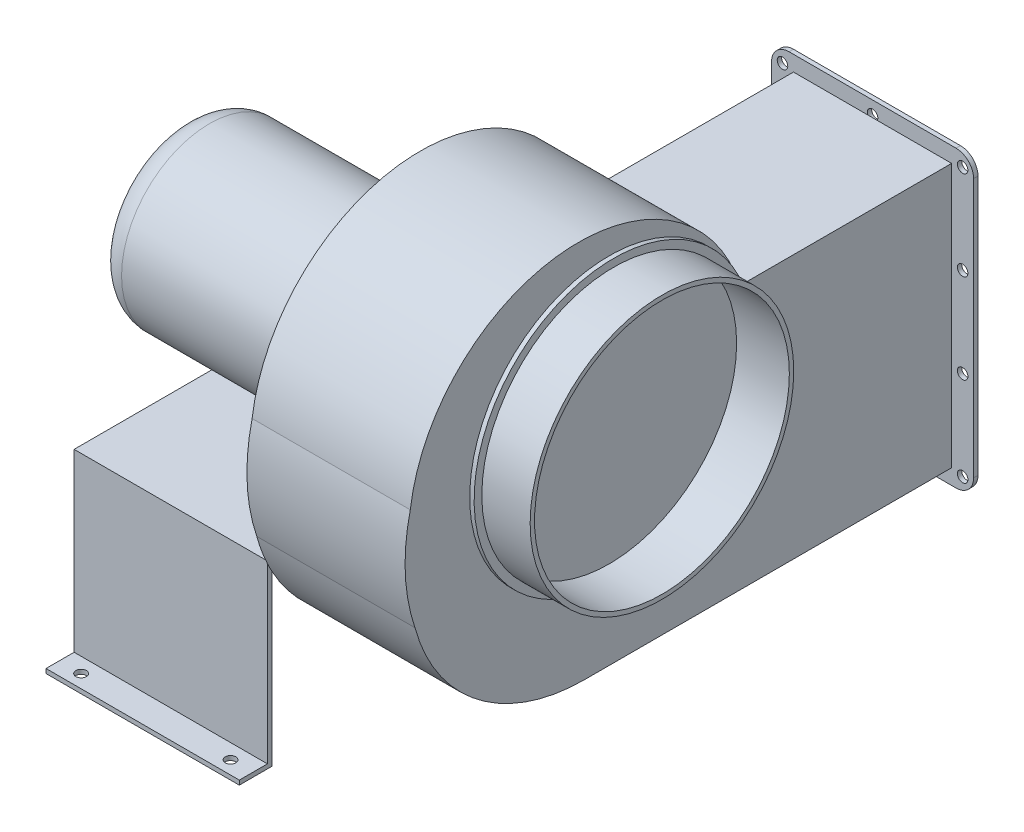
ISO-10303-21;
HEADER;
FILE_DESCRIPTION(('STEP AP214'),'2;1');
FILE_NAME('part.step','',(''),(''),'','','');
FILE_SCHEMA(('AUTOMOTIVE_DESIGN { 1 0 10303 214 1 1 1 1 }'));
ENDSEC;
DATA;
#1=APPLICATION_CONTEXT('core data for automotive mechanical design processes');
#2=APPLICATION_PROTOCOL_DEFINITION('international standard','automotive_design',2000,#1);
#3=PRODUCT_CONTEXT('',#1,'mechanical');
#4=PRODUCT('Part','Part','',(#3));
#5=PRODUCT_RELATED_PRODUCT_CATEGORY('part','',(#4));
#6=PRODUCT_DEFINITION_FORMATION('','',#4);
#7=PRODUCT_DEFINITION_CONTEXT('part definition',#1,'design');
#8=PRODUCT_DEFINITION('design','',#6,#7);
#9=PRODUCT_DEFINITION_SHAPE('','',#8);
#10=(LENGTH_UNIT() NAMED_UNIT(*) SI_UNIT(.MILLI.,.METRE.));
#11=(NAMED_UNIT(*) PLANE_ANGLE_UNIT() SI_UNIT($,.RADIAN.));
#12=(NAMED_UNIT(*) SI_UNIT($,.STERADIAN.) SOLID_ANGLE_UNIT());
#13=UNCERTAINTY_MEASURE_WITH_UNIT(LENGTH_MEASURE(1.E-05),#10,'distance_accuracy_value','');
#14=(GEOMETRIC_REPRESENTATION_CONTEXT(3) GLOBAL_UNCERTAINTY_ASSIGNED_CONTEXT((#13)) GLOBAL_UNIT_ASSIGNED_CONTEXT((#10,
#11,#12)) REPRESENTATION_CONTEXT('',''));
#15=CARTESIAN_POINT('',(0.,0.,0.));
#16=DIRECTION('',(0.,0.,1.));
#17=DIRECTION('',(1.,0.,0.));
#18=AXIS2_PLACEMENT_3D('',#15,#16,#17);
#19=CARTESIAN_POINT('',(180.,-17.5,118.5));
#20=DIRECTION('',(-1.,0.,0.));
#21=DIRECTION('',(0.,0.,1.));
#22=AXIS2_PLACEMENT_3D('',#19,#20,#21);
#23=CYLINDRICAL_SURFACE('',#22,193.031733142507);
#24=CARTESIAN_POINT('',(0.,-17.5,118.5));
#25=DIRECTION('',(1.,0.,0.));
#26=DIRECTION('',(0.,0.,-1.));
#27=AXIS2_PLACEMENT_3D('',#24,#25,#26);
#28=CIRCLE('',#27,193.031733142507);
#29=CARTESIAN_POINT('',(0.,41.,-65.4537985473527));
#30=VERTEX_POINT('',#29);
#31=CARTESIAN_POINT('',(0.,7.54878527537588,309.899603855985));
#32=VERTEX_POINT('',#31);
#33=EDGE_CURVE('E591',#30,#32,#28,.T.);
#34=ORIENTED_EDGE('',*,*,#33,.T.);
#35=DIRECTION('',(-1.,0.,0.));
#36=VECTOR('',#35,1.);
#37=CARTESIAN_POINT('',(90.,7.54878527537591,309.899603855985));
#38=LINE('',#37,#36);
#39=CARTESIAN_POINT('',(180.,7.54878527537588,309.899603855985));
#40=VERTEX_POINT('',#39);
#41=EDGE_CURVE('E264',#32,#40,#38,.F.);
#42=ORIENTED_EDGE('',*,*,#41,.T.);
#43=CARTESIAN_POINT('',(180.,-17.5,118.5));
#44=DIRECTION('',(1.,0.,0.));
#45=DIRECTION('',(0.,0.,-1.));
#46=AXIS2_PLACEMENT_3D('',#43,#44,#45);
#47=CIRCLE('',#46,193.031733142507);
#48=CARTESIAN_POINT('',(180.,41.,-65.4537985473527));
#49=VERTEX_POINT('',#48);
#50=EDGE_CURVE('E274',#49,#40,#47,.T.);
#51=ORIENTED_EDGE('',*,*,#50,.F.);
#52=DIRECTION('',(-1.,0.,0.));
#53=VECTOR('',#52,1.);
#54=CARTESIAN_POINT('',(180.,41.,-65.4537985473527));
#55=LINE('',#54,#53);
#56=EDGE_CURVE('E594',#49,#30,#55,.T.);
#57=ORIENTED_EDGE('',*,*,#56,.T.);
#58=EDGE_LOOP('',(#34,#42,#51,#57));
#59=FACE_BOUND('',#58,.T.);
#60=ADVANCED_FACE('F33',(#59),#23,.T.);
#61=CARTESIAN_POINT('',(0.,-17.5,118.5));
#62=DIRECTION('',(1.,0.,0.));
#63=DIRECTION('',(0.,0.,-1.));
#64=AXIS2_PLACEMENT_3D('',#61,#62,#63);
#65=PLANE('',#64);
#66=DIRECTION('',(0.,1.,0.));
#67=VECTOR('',#66,1.);
#68=CARTESIAN_POINT('',(0.,-146.5,-50.5));
#69=LINE('',#68,#67);
#70=CARTESIAN_POINT('',(0.,-259.,-50.5));
#71=VERTEX_POINT('',#70);
#72=CARTESIAN_POINT('',(0.,-146.5,-50.5));
#73=VERTEX_POINT('',#72);
#74=EDGE_CURVE('E351',#71,#73,#69,.T.);
#75=ORIENTED_EDGE('',*,*,#74,.F.);
#76=DIRECTION('',(0.,0.,-1.));
#77=VECTOR('',#76,1.);
#78=CARTESIAN_POINT('',(0.,-259.,83.5));
#79=LINE('',#78,#77);
#80=CARTESIAN_POINT('',(0.,-259.,111.531733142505));
#81=VERTEX_POINT('',#80);
#82=EDGE_CURVE('E595',#81,#71,#79,.T.);
#83=ORIENTED_EDGE('',*,*,#82,.F.);
#84=CARTESIAN_POINT('',(0.,-59.,111.531733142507));
#85=DIRECTION('',(-1.,0.,0.));
#86=DIRECTION('',(0.,0.,-1.));
#87=AXIS2_PLACEMENT_3D('',#84,#85,#86);
#88=CIRCLE('',#87,200.);
#89=CARTESIAN_POINT('',(0.,-154.053506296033,287.5));
#90=VERTEX_POINT('',#89);
#91=EDGE_CURVE('E281',#81,#90,#88,.T.);
#92=ORIENTED_EDGE('',*,*,#91,.T.);
#93=DIRECTION('',(0.,-1.,0.));
#94=VECTOR('',#93,1.);
#95=CARTESIAN_POINT('',(0.,-146.5,287.5));
#96=LINE('',#95,#94);
#97=CARTESIAN_POINT('',(0.,-146.5,287.5));
#98=VERTEX_POINT('',#97);
#99=EDGE_CURVE('E358',#98,#90,#96,.T.);
#100=ORIENTED_EDGE('',*,*,#99,.F.);
#101=DIRECTION('',(0.,0.,1.));
#102=VECTOR('',#101,1.);
#103=CARTESIAN_POINT('',(0.,-146.5,287.5));
#104=LINE('',#103,#102);
#105=EDGE_CURVE('E355',#73,#98,#104,.T.);
#106=ORIENTED_EDGE('',*,*,#105,.F.);
#107=EDGE_LOOP('',(#75,#83,#92,#100,#106));
#108=FACE_BOUND('',#107,.T.);
#109=ADVANCED_FACE('F631',(#108),#65,.F.);
#110=CARTESIAN_POINT('',(0.,-42.6399954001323,101.093053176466));
#111=DIRECTION('',(-1.,0.,0.));
#112=DIRECTION('',(0.,0.,1.));
#113=AXIS2_PLACEMENT_3D('',#110,#111,#112);
#114=CIRCLE('',#113,214.753554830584);
#115=CARTESIAN_POINT('',(0.,-111.338318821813,304.562042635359));
#116=VERTEX_POINT('',#115);
#117=EDGE_CURVE('E259',#116,#32,#114,.T.);
#118=ORIENTED_EDGE('',*,*,#117,.T.);
#119=ORIENTED_EDGE('',*,*,#33,.F.);
#120=DIRECTION('',(0.,0.,1.));
#121=VECTOR('',#120,1.);
#122=CARTESIAN_POINT('',(0.,41.,-65.5));
#123=LINE('',#122,#121);
#124=CARTESIAN_POINT('',(0.,41.,-306.2));
#125=VERTEX_POINT('',#124);
#126=EDGE_CURVE('E598',#125,#30,#123,.T.);
#127=ORIENTED_EDGE('',*,*,#126,.F.);
#128=DIRECTION('',(0.,1.,0.));
#129=VECTOR('',#128,1.);
#130=CARTESIAN_POINT('',(0.,-17.5,-306.2));
#131=LINE('',#130,#129);
#132=CARTESIAN_POINT('',(0.,-259.,-306.2));
#133=VERTEX_POINT('',#132);
#134=EDGE_CURVE('E569',#133,#125,#131,.T.);
#135=ORIENTED_EDGE('',*,*,#134,.F.);
#136=CARTESIAN_POINT('',(0.,-259.,-55.5));
#137=VERTEX_POINT('',#136);
#138=EDGE_CURVE('E587',#137,#133,#79,.T.);
#139=ORIENTED_EDGE('',*,*,#138,.F.);
#140=DIRECTION('',(0.,-1.,0.));
#141=VECTOR('',#140,1.);
#142=CARTESIAN_POINT('',(0.,-341.5,-55.5));
#143=LINE('',#142,#141);
#144=CARTESIAN_POINT('',(0.,-141.5,-55.5));
#145=VERTEX_POINT('',#144);
#146=EDGE_CURVE('E322',#145,#137,#143,.T.);
#147=ORIENTED_EDGE('',*,*,#146,.F.);
#148=DIRECTION('',(0.,0.,-1.));
#149=VECTOR('',#148,1.);
#150=CARTESIAN_POINT('',(0.,-141.5,-55.5));
#151=LINE('',#150,#149);
#152=CARTESIAN_POINT('',(0.,-141.5,292.5));
#153=VERTEX_POINT('',#152);
#154=EDGE_CURVE('E370',#153,#145,#151,.T.);
#155=ORIENTED_EDGE('',*,*,#154,.F.);
#156=DIRECTION('',(0.,1.,0.));
#157=VECTOR('',#156,1.);
#158=CARTESIAN_POINT('',(0.,-341.5,292.5));
#159=LINE('',#158,#157);
#160=CARTESIAN_POINT('',(0.,-144.14978796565,292.5));
#161=VERTEX_POINT('',#160);
#162=EDGE_CURVE('E283',#161,#153,#159,.T.);
#163=ORIENTED_EDGE('',*,*,#162,.F.);
#164=EDGE_CURVE('E288',#161,#116,#88,.T.);
#165=ORIENTED_EDGE('',*,*,#164,.T.);
#166=EDGE_LOOP('',(#118,#119,#127,#135,#139,#147,#155,#163,#165));
#167=FACE_BOUND('',#166,.T.);
#168=CARTESIAN_POINT('',(0.,-17.5,118.5));
#169=DIRECTION('',(1.,0.,0.));
#170=DIRECTION('',(0.,0.,-1.));
#171=AXIS2_PLACEMENT_3D('',#168,#169,#170);
#172=CIRCLE('',#171,100.);
#173=CARTESIAN_POINT('',(0.,-17.5,18.5));
#174=VERTEX_POINT('',#173);
#175=EDGE_CURVE('E610',#174,#174,#172,.F.);
#176=ORIENTED_EDGE('',*,*,#175,.F.);
#177=EDGE_LOOP('',(#176));
#178=FACE_BOUND('',#177,.T.);
#179=ADVANCED_FACE('F637',(#167,#178),#65,.F.);
#180=CARTESIAN_POINT('',(180.,-259.,83.5));
#181=DIRECTION('',(0.,1.,0.));
#182=DIRECTION('',(0.,0.,1.));
#183=AXIS2_PLACEMENT_3D('',#180,#181,#182);
#184=PLANE('',#183);
#185=DIRECTION('',(-1.,0.,0.));
#186=VECTOR('',#185,1.);
#187=CARTESIAN_POINT('',(180.,-259.,-306.2));
#188=LINE('',#187,#186);
#189=CARTESIAN_POINT('',(180.,-259.,-306.2));
#190=VERTEX_POINT('',#189);
#191=CARTESIAN_POINT('',(95.4543560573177,-259.,-306.2));
#192=VERTEX_POINT('',#191);
#193=EDGE_CURVE('E566',#190,#192,#188,.T.);
#194=ORIENTED_EDGE('',*,*,#193,.F.);
#195=DIRECTION('',(0.,0.,-1.));
#196=VECTOR('',#195,1.);
#197=CARTESIAN_POINT('',(180.,-259.,83.5));
#198=LINE('',#197,#196);
#199=CARTESIAN_POINT('',(180.,-259.,111.531733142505));
#200=VERTEX_POINT('',#199);
#201=EDGE_CURVE('E588',#200,#190,#198,.T.);
#202=ORIENTED_EDGE('',*,*,#201,.F.);
#203=DIRECTION('',(-1.,0.,0.));
#204=VECTOR('',#203,1.);
#205=CARTESIAN_POINT('',(180.,-259.,111.531733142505));
#206=LINE('',#205,#204);
#207=EDGE_CURVE('E280',#200,#81,#206,.T.);
#208=ORIENTED_EDGE('',*,*,#207,.T.);
#209=ORIENTED_EDGE('',*,*,#82,.T.);
#210=DIRECTION('',(0.,0.,1.));
#211=VECTOR('',#210,1.);
#212=CARTESIAN_POINT('',(0.,-259.,83.5));
#213=LINE('',#212,#211);
#214=EDGE_CURVE('E410',#137,#71,#213,.T.);
#215=ORIENTED_EDGE('',*,*,#214,.F.);
#216=ORIENTED_EDGE('',*,*,#138,.T.);
#217=CARTESIAN_POINT('',(84.5456439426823,-259.,-306.2));
#218=VERTEX_POINT('',#217);
#219=EDGE_CURVE('E564',#218,#133,#188,.T.);
#220=ORIENTED_EDGE('',*,*,#219,.F.);
#221=EDGE_CURVE('E570',#192,#218,#188,.T.);
#222=ORIENTED_EDGE('',*,*,#221,.F.);
#223=EDGE_LOOP('',(#194,#202,#208,#209,#215,#216,#220,#222));
#224=FACE_BOUND('',#223,.T.);
#225=ADVANCED_FACE('F644',(#224),#184,.F.);
#226=CARTESIAN_POINT('',(180.,41.,-65.5));
#227=DIRECTION('',(0.,-1.,0.));
#228=DIRECTION('',(0.,0.,-1.));
#229=AXIS2_PLACEMENT_3D('',#226,#227,#228);
#230=PLANE('',#229);
#231=DIRECTION('',(1.,0.,0.));
#232=VECTOR('',#231,1.);
#233=CARTESIAN_POINT('',(180.,41.,-306.2));
#234=LINE('',#233,#232);
#235=CARTESIAN_POINT('',(84.545643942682,41.,-306.2));
#236=VERTEX_POINT('',#235);
#237=EDGE_CURVE('E561',#125,#236,#234,.T.);
#238=ORIENTED_EDGE('',*,*,#237,.F.);
#239=ORIENTED_EDGE('',*,*,#126,.T.);
#240=ORIENTED_EDGE('',*,*,#56,.F.);
#241=DIRECTION('',(0.,0.,1.));
#242=VECTOR('',#241,1.);
#243=CARTESIAN_POINT('',(180.,41.,-311.5));
#244=LINE('',#243,#242);
#245=CARTESIAN_POINT('',(180.,41.,-306.2));
#246=VERTEX_POINT('',#245);
#247=EDGE_CURVE('E590',#246,#49,#244,.T.);
#248=ORIENTED_EDGE('',*,*,#247,.F.);
#249=CARTESIAN_POINT('',(95.454356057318,41.,-306.2));
#250=VERTEX_POINT('',#249);
#251=EDGE_CURVE('E560',#250,#246,#234,.T.);
#252=ORIENTED_EDGE('',*,*,#251,.F.);
#253=EDGE_CURVE('E565',#236,#250,#234,.T.);
#254=ORIENTED_EDGE('',*,*,#253,.F.);
#255=EDGE_LOOP('',(#238,#239,#240,#248,#252,#254));
#256=FACE_BOUND('',#255,.T.);
#257=ADVANCED_FACE('F642',(#256),#230,.F.);
#258=CARTESIAN_POINT('',(180.,-17.5,118.5));
#259=DIRECTION('',(1.,0.,0.));
#260=DIRECTION('',(0.,0.,-1.));
#261=AXIS2_PLACEMENT_3D('',#258,#259,#260);
#262=PLANE('',#261);
#263=ORIENTED_EDGE('',*,*,#50,.T.);
#264=CARTESIAN_POINT('',(180.,-42.6399954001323,101.093053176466));
#265=DIRECTION('',(-1.,0.,0.));
#266=DIRECTION('',(0.,0.,1.));
#267=AXIS2_PLACEMENT_3D('',#264,#265,#266);
#268=CIRCLE('',#267,214.753554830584);
#269=CARTESIAN_POINT('',(180.,-111.338318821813,304.562042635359));
#270=VERTEX_POINT('',#269);
#271=EDGE_CURVE('E256',#270,#40,#268,.T.);
#272=ORIENTED_EDGE('',*,*,#271,.F.);
#273=CARTESIAN_POINT('',(180.,-59.,111.531733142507));
#274=DIRECTION('',(-1.,0.,0.));
#275=DIRECTION('',(0.,0.,-1.));
#276=AXIS2_PLACEMENT_3D('',#273,#274,#275);
#277=CIRCLE('',#276,200.);
#278=EDGE_CURVE('E271',#200,#270,#277,.T.);
#279=ORIENTED_EDGE('',*,*,#278,.F.);
#280=ORIENTED_EDGE('',*,*,#201,.T.);
#281=DIRECTION('',(0.,1.,0.));
#282=VECTOR('',#281,1.);
#283=CARTESIAN_POINT('',(180.,-17.5,-306.2));
#284=LINE('',#283,#282);
#285=EDGE_CURVE('E607',#190,#246,#284,.T.);
#286=ORIENTED_EDGE('',*,*,#285,.T.);
#287=ORIENTED_EDGE('',*,*,#247,.T.);
#288=CARTESIAN_POINT('',(180.,-14.,83.5));
#289=DIRECTION('',(1.,0.,0.));
#290=DIRECTION('',(0.,0.,-1.));
#291=AXIS2_PLACEMENT_3D('',#288,#289,#290);
#292=CIRCLE('',#291,158.783607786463);
#293=EDGE_CURVE('E575',#49,#49,#292,.T.);
#294=ORIENTED_EDGE('',*,*,#293,.F.);
#295=EDGE_LOOP('',(#263,#272,#279,#280,#286,#287,#294));
#296=FACE_BOUND('',#295,.T.);
#297=ADVANCED_FACE('F269',(#296),#262,.T.);
#298=CARTESIAN_POINT('',(240.,-14.,83.5));
#299=DIRECTION('',(1.,0.,0.));
#300=DIRECTION('',(0.,0.,-1.));
#301=AXIS2_PLACEMENT_3D('',#298,#299,#300);
#302=PLANE('',#301);
#303=CARTESIAN_POINT('',(240.,-14.,83.5));
#304=DIRECTION('',(1.,0.,0.));
#305=DIRECTION('',(0.,0.,-1.));
#306=AXIS2_PLACEMENT_3D('',#303,#304,#305);
#307=CIRCLE('',#306,150.);
#308=CARTESIAN_POINT('',(240.,-14.,-66.5000000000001));
#309=VERTEX_POINT('',#308);
#310=EDGE_CURVE('E584',#309,#309,#307,.T.);
#311=ORIENTED_EDGE('',*,*,#310,.T.);
#312=EDGE_LOOP('',(#311));
#313=FACE_BOUND('',#312,.T.);
#314=CARTESIAN_POINT('',(240.,-14.,83.5));
#315=DIRECTION('',(1.,0.,0.));
#316=DIRECTION('',(0.,0.,-1.));
#317=AXIS2_PLACEMENT_3D('',#314,#315,#316);
#318=CIRCLE('',#317,145.);
#319=CARTESIAN_POINT('',(240.,-14.,-61.5));
#320=VERTEX_POINT('',#319);
#321=EDGE_CURVE('E579',#320,#320,#318,.T.);
#322=ORIENTED_EDGE('',*,*,#321,.F.);
#323=EDGE_LOOP('',(#322));
#324=FACE_BOUND('',#323,.T.);
#325=ADVANCED_FACE('F846',(#313,#324),#302,.T.);
#326=CARTESIAN_POINT('',(240.,-14.,83.5));
#327=DIRECTION('',(-1.,0.,0.));
#328=DIRECTION('',(0.,0.,1.));
#329=AXIS2_PLACEMENT_3D('',#326,#327,#328);
#330=CYLINDRICAL_SURFACE('',#329,150.);
#331=CARTESIAN_POINT('',(185.,-14.,83.5));
#332=DIRECTION('',(1.,0.,0.));
#333=DIRECTION('',(0.,0.,-1.));
#334=AXIS2_PLACEMENT_3D('',#331,#332,#333);
#335=CIRCLE('',#334,150.);
#336=CARTESIAN_POINT('',(185.,-14.,-66.5000000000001));
#337=VERTEX_POINT('',#336);
#338=EDGE_CURVE('E572',#337,#337,#335,.T.);
#339=ORIENTED_EDGE('',*,*,#338,.T.);
#340=EDGE_LOOP('',(#339));
#341=FACE_BOUND('',#340,.T.);
#342=ORIENTED_EDGE('',*,*,#310,.F.);
#343=EDGE_LOOP('',(#342));
#344=FACE_BOUND('',#343,.T.);
#345=ADVANCED_FACE('F844',(#341,#344),#330,.T.);
#346=CARTESIAN_POINT('',(240.,-14.,83.5));
#347=DIRECTION('',(-1.,0.,0.));
#348=DIRECTION('',(0.,0.,1.));
#349=AXIS2_PLACEMENT_3D('',#346,#347,#348);
#350=CYLINDRICAL_SURFACE('',#349,145.);
#351=ORIENTED_EDGE('',*,*,#321,.T.);
#352=EDGE_LOOP('',(#351));
#353=FACE_BOUND('',#352,.T.);
#354=CARTESIAN_POINT('',(180.,-14.,83.5));
#355=DIRECTION('',(1.,0.,0.));
#356=DIRECTION('',(0.,0.,-1.));
#357=AXIS2_PLACEMENT_3D('',#354,#355,#356);
#358=CIRCLE('',#357,145.);
#359=CARTESIAN_POINT('',(180.,-14.,-61.5));
#360=VERTEX_POINT('',#359);
#361=EDGE_CURVE('E604',#360,#360,#358,.F.);
#362=ORIENTED_EDGE('',*,*,#361,.T.);
#363=EDGE_LOOP('',(#362));
#364=FACE_BOUND('',#363,.T.);
#365=ADVANCED_FACE('F841',(#353,#364),#350,.F.);
#366=ORIENTED_EDGE('',*,*,#361,.F.);
#367=EDGE_LOOP('',(#366));
#368=FACE_BOUND('',#367,.T.);
#369=ADVANCED_FACE('F836',(#368),#262,.T.);
#370=CARTESIAN_POINT('',(185.,-14.,83.5));
#371=DIRECTION('',(1.,0.,0.));
#372=DIRECTION('',(0.,0.,-1.));
#373=AXIS2_PLACEMENT_3D('',#370,#371,#372);
#374=PLANE('',#373);
#375=CARTESIAN_POINT('',(185.,-14.,83.5));
#376=DIRECTION('',(1.,0.,0.));
#377=DIRECTION('',(0.,0.,-1.));
#378=AXIS2_PLACEMENT_3D('',#375,#376,#377);
#379=CIRCLE('',#378,158.783607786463);
#380=CARTESIAN_POINT('',(185.,-14.,-75.283607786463));
#381=VERTEX_POINT('',#380);
#382=EDGE_CURVE('E576',#381,#381,#379,.T.);
#383=ORIENTED_EDGE('',*,*,#382,.T.);
#384=EDGE_LOOP('',(#383));
#385=FACE_BOUND('',#384,.T.);
#386=ORIENTED_EDGE('',*,*,#338,.F.);
#387=EDGE_LOOP('',(#386));
#388=FACE_BOUND('',#387,.T.);
#389=ADVANCED_FACE('F833',(#385,#388),#374,.T.);
#390=CARTESIAN_POINT('',(185.,-14.,83.5));
#391=DIRECTION('',(-1.,0.,0.));
#392=DIRECTION('',(0.,0.,1.));
#393=AXIS2_PLACEMENT_3D('',#390,#391,#392);
#394=CYLINDRICAL_SURFACE('',#393,158.783607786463);
#395=ORIENTED_EDGE('',*,*,#382,.F.);
#396=EDGE_LOOP('',(#395));
#397=FACE_BOUND('',#396,.T.);
#398=ORIENTED_EDGE('',*,*,#293,.T.);
#399=EDGE_LOOP('',(#398));
#400=FACE_BOUND('',#399,.T.);
#401=ADVANCED_FACE('F801',(#397,#400),#394,.T.);
#402=CARTESIAN_POINT('',(-5.00000000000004,-256.5,-306.2));
#403=DIRECTION('',(0.,0.,-1.));
#404=DIRECTION('',(-1.,0.,0.));
#405=AXIS2_PLACEMENT_3D('',#402,#403,#404);
#406=PLANE('',#405);
#407=CARTESIAN_POINT('',(-12.5000000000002,-58.1000000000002,-306.2));
#408=DIRECTION('',(0.,0.,-1.));
#409=DIRECTION('',(-1.,0.,0.));
#410=AXIS2_PLACEMENT_3D('',#407,#408,#409);
#411=CIRCLE('',#410,6.);
#412=CARTESIAN_POINT('',(-18.5000000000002,-58.1000000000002,-306.2));
#413=VERTEX_POINT('',#412);
#414=EDGE_CURVE('E423',#413,#413,#411,.T.);
#415=ORIENTED_EDGE('',*,*,#414,.T.);
#416=EDGE_LOOP('',(#415));
#417=FACE_BOUND('',#416,.T.);
#418=CARTESIAN_POINT('',(-12.5000000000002,-159.9,-306.2));
#419=DIRECTION('',(0.,0.,-1.));
#420=DIRECTION('',(-1.,0.,0.));
#421=AXIS2_PLACEMENT_3D('',#418,#419,#420);
#422=CIRCLE('',#421,6.);
#423=CARTESIAN_POINT('',(-18.5000000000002,-159.9,-306.2));
#424=VERTEX_POINT('',#423);
#425=EDGE_CURVE('E429',#424,#424,#422,.T.);
#426=ORIENTED_EDGE('',*,*,#425,.T.);
#427=EDGE_LOOP('',(#426));
#428=FACE_BOUND('',#427,.T.);
#429=CARTESIAN_POINT('',(192.5,-159.9,-306.2));
#430=DIRECTION('',(0.,0.,-1.));
#431=DIRECTION('',(-1.,0.,0.));
#432=AXIS2_PLACEMENT_3D('',#429,#430,#431);
#433=CIRCLE('',#432,6.00000000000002);
#434=CARTESIAN_POINT('',(186.5,-159.9,-306.2));
#435=VERTEX_POINT('',#434);
#436=EDGE_CURVE('E435',#435,#435,#433,.T.);
#437=ORIENTED_EDGE('',*,*,#436,.T.);
#438=EDGE_LOOP('',(#437));
#439=FACE_BOUND('',#438,.T.);
#440=CARTESIAN_POINT('',(192.5,-58.1000000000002,-306.2));
#441=DIRECTION('',(0.,0.,-1.));
#442=DIRECTION('',(-1.,0.,0.));
#443=AXIS2_PLACEMENT_3D('',#440,#441,#442);
#444=CIRCLE('',#443,6.00000000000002);
#445=CARTESIAN_POINT('',(186.5,-58.1000000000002,-306.2));
#446=VERTEX_POINT('',#445);
#447=EDGE_CURVE('E441',#446,#446,#444,.T.);
#448=ORIENTED_EDGE('',*,*,#447,.T.);
#449=EDGE_LOOP('',(#448));
#450=FACE_BOUND('',#449,.T.);
#451=CARTESIAN_POINT('',(192.5,-261.5,-306.2));
#452=DIRECTION('',(0.,0.,-1.));
#453=DIRECTION('',(-1.,0.,0.));
#454=AXIS2_PLACEMENT_3D('',#451,#452,#453);
#455=CIRCLE('',#454,6.00000000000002);
#456=CARTESIAN_POINT('',(186.5,-261.5,-306.2));
#457=VERTEX_POINT('',#456);
#458=EDGE_CURVE('E447',#457,#457,#455,.T.);
#459=ORIENTED_EDGE('',*,*,#458,.T.);
#460=EDGE_LOOP('',(#459));
#461=FACE_BOUND('',#460,.T.);
#462=CARTESIAN_POINT('',(-12.5000000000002,-261.5,-306.2));
#463=DIRECTION('',(0.,0.,-1.));
#464=DIRECTION('',(-1.,0.,0.));
#465=AXIS2_PLACEMENT_3D('',#462,#463,#464);
#466=CIRCLE('',#465,6.);
#467=CARTESIAN_POINT('',(-18.5000000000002,-261.5,-306.2));
#468=VERTEX_POINT('',#467);
#469=EDGE_CURVE('E453',#468,#468,#466,.T.);
#470=ORIENTED_EDGE('',*,*,#469,.T.);
#471=EDGE_LOOP('',(#470));
#472=FACE_BOUND('',#471,.T.);
#473=CARTESIAN_POINT('',(-12.5000000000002,43.4999999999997,-306.2));
#474=DIRECTION('',(0.,0.,-1.));
#475=DIRECTION('',(-1.,0.,0.));
#476=AXIS2_PLACEMENT_3D('',#473,#474,#475);
#477=CIRCLE('',#476,6.);
#478=CARTESIAN_POINT('',(-18.5000000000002,43.4999999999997,-306.2));
#479=VERTEX_POINT('',#478);
#480=EDGE_CURVE('E459',#479,#479,#477,.T.);
#481=ORIENTED_EDGE('',*,*,#480,.T.);
#482=EDGE_LOOP('',(#481));
#483=FACE_BOUND('',#482,.T.);
#484=CARTESIAN_POINT('',(192.5,43.4999999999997,-306.2));
#485=DIRECTION('',(0.,0.,-1.));
#486=DIRECTION('',(-1.,0.,0.));
#487=AXIS2_PLACEMENT_3D('',#484,#485,#486);
#488=CIRCLE('',#487,6.00000000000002);
#489=CARTESIAN_POINT('',(186.5,43.4999999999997,-306.2));
#490=VERTEX_POINT('',#489);
#491=EDGE_CURVE('E465',#490,#490,#488,.T.);
#492=ORIENTED_EDGE('',*,*,#491,.T.);
#493=EDGE_LOOP('',(#492));
#494=FACE_BOUND('',#493,.T.);
#495=CARTESIAN_POINT('',(-5.00000000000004,-256.5,-306.2));
#496=DIRECTION('',(0.,0.,-1.));
#497=DIRECTION('',(-1.,0.,0.));
#498=AXIS2_PLACEMENT_3D('',#495,#496,#497);
#499=CIRCLE('',#498,20.);
#500=CARTESIAN_POINT('',(-4.9999999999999,-276.5,-306.2));
#501=VERTEX_POINT('',#500);
#502=CARTESIAN_POINT('',(-25.,-256.5,-306.2));
#503=VERTEX_POINT('',#502);
#504=EDGE_CURVE('E496',#501,#503,#499,.T.);
#505=ORIENTED_EDGE('',*,*,#504,.F.);
#506=DIRECTION('',(-1.,0.,0.));
#507=VECTOR('',#506,1.);
#508=CARTESIAN_POINT('',(185.,-276.5,-306.2));
#509=LINE('',#508,#507);
#510=CARTESIAN_POINT('',(185.,-276.5,-306.2));
#511=VERTEX_POINT('',#510);
#512=EDGE_CURVE('E507',#511,#501,#509,.T.);
#513=ORIENTED_EDGE('',*,*,#512,.F.);
#514=CARTESIAN_POINT('',(185.,-256.5,-306.2));
#515=DIRECTION('',(0.,0.,-1.));
#516=DIRECTION('',(1.,0.,0.));
#517=AXIS2_PLACEMENT_3D('',#514,#515,#516);
#518=CIRCLE('',#517,20.);
#519=CARTESIAN_POINT('',(205.,-256.5,-306.2));
#520=VERTEX_POINT('',#519);
#521=EDGE_CURVE('E534',#520,#511,#518,.T.);
#522=ORIENTED_EDGE('',*,*,#521,.F.);
#523=DIRECTION('',(0.,-1.,0.));
#524=VECTOR('',#523,1.);
#525=CARTESIAN_POINT('',(205.,-256.5,-306.2));
#526=LINE('',#525,#524);
#527=CARTESIAN_POINT('',(205.,38.4999999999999,-306.2));
#528=VERTEX_POINT('',#527);
#529=EDGE_CURVE('E532',#528,#520,#526,.T.);
#530=ORIENTED_EDGE('',*,*,#529,.F.);
#531=CARTESIAN_POINT('',(185.,38.5,-306.2));
#532=DIRECTION('',(0.,0.,-1.));
#533=DIRECTION('',(1.,0.,0.));
#534=AXIS2_PLACEMENT_3D('',#531,#532,#533);
#535=CIRCLE('',#534,20.);
#536=CARTESIAN_POINT('',(185.,58.5,-306.2));
#537=VERTEX_POINT('',#536);
#538=EDGE_CURVE('E530',#537,#528,#535,.T.);
#539=ORIENTED_EDGE('',*,*,#538,.F.);
#540=DIRECTION('',(1.,0.,0.));
#541=VECTOR('',#540,1.);
#542=CARTESIAN_POINT('',(185.,58.5,-306.2));
#543=LINE('',#542,#541);
#544=CARTESIAN_POINT('',(-4.9999999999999,58.5,-306.2));
#545=VERTEX_POINT('',#544);
#546=EDGE_CURVE('E528',#545,#537,#543,.T.);
#547=ORIENTED_EDGE('',*,*,#546,.F.);
#548=CARTESIAN_POINT('',(-5.00000000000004,38.5,-306.2));
#549=DIRECTION('',(0.,0.,-1.));
#550=DIRECTION('',(1.,0.,0.));
#551=AXIS2_PLACEMENT_3D('',#548,#549,#550);
#552=CIRCLE('',#551,20.);
#553=CARTESIAN_POINT('',(-25.,38.4999999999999,-306.2));
#554=VERTEX_POINT('',#553);
#555=EDGE_CURVE('E526',#554,#545,#552,.T.);
#556=ORIENTED_EDGE('',*,*,#555,.F.);
#557=DIRECTION('',(0.,1.,0.));
#558=VECTOR('',#557,1.);
#559=CARTESIAN_POINT('',(-25.,-256.5,-306.2));
#560=LINE('',#559,#558);
#561=EDGE_CURVE('E524',#503,#554,#560,.T.);
#562=ORIENTED_EDGE('',*,*,#561,.F.);
#563=EDGE_LOOP('',(#505,#513,#522,#530,#539,#547,#556,#562));
#564=FACE_BOUND('',#563,.T.);
#565=ORIENTED_EDGE('',*,*,#193,.T.);
#566=CARTESIAN_POINT('',(90.,-261.5,-306.2));
#567=DIRECTION('',(0.,0.,-1.));
#568=DIRECTION('',(-1.,0.,0.));
#569=AXIS2_PLACEMENT_3D('',#566,#567,#568);
#570=CIRCLE('',#569,6.);
#571=EDGE_CURVE('E415',#192,#218,#570,.T.);
#572=ORIENTED_EDGE('',*,*,#571,.T.);
#573=ORIENTED_EDGE('',*,*,#219,.T.);
#574=ORIENTED_EDGE('',*,*,#134,.T.);
#575=ORIENTED_EDGE('',*,*,#237,.T.);
#576=CARTESIAN_POINT('',(90.,43.4999999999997,-306.2));
#577=DIRECTION('',(0.,0.,-1.));
#578=DIRECTION('',(-1.,0.,0.));
#579=AXIS2_PLACEMENT_3D('',#576,#577,#578);
#580=CIRCLE('',#579,6.);
#581=EDGE_CURVE('E420',#236,#250,#580,.T.);
#582=ORIENTED_EDGE('',*,*,#581,.T.);
#583=ORIENTED_EDGE('',*,*,#251,.T.);
#584=ORIENTED_EDGE('',*,*,#285,.F.);
#585=EDGE_LOOP('',(#565,#572,#573,#574,#575,#582,#583,#584));
#586=FACE_BOUND('',#585,.T.);
#587=ADVANCED_FACE('F724',(#417,#428,#439,#450,#461,#472,#483,#494,#564,#586),#406,.F.);
#588=CARTESIAN_POINT('',(-5.00000000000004,-256.5,-311.2));
#589=DIRECTION('',(0.,0.,1.));
#590=DIRECTION('',(1.,0.,0.));
#591=AXIS2_PLACEMENT_3D('',#588,#589,#590);
#592=CYLINDRICAL_SURFACE('',#591,20.);
#593=ORIENTED_EDGE('',*,*,#504,.T.);
#594=DIRECTION('',(0.,0.,1.));
#595=VECTOR('',#594,1.);
#596=CARTESIAN_POINT('',(-25.,-256.5,-311.2));
#597=LINE('',#596,#595);
#598=CARTESIAN_POINT('',(-25.,-256.5,-311.2));
#599=VERTEX_POINT('',#598);
#600=EDGE_CURVE('E557',#599,#503,#597,.T.);
#601=ORIENTED_EDGE('',*,*,#600,.F.);
#602=CARTESIAN_POINT('',(-5.00000000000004,-256.5,-311.2));
#603=DIRECTION('',(0.,0.,-1.));
#604=DIRECTION('',(-1.,0.,0.));
#605=AXIS2_PLACEMENT_3D('',#602,#603,#604);
#606=CIRCLE('',#605,20.);
#607=CARTESIAN_POINT('',(-4.9999999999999,-276.5,-311.2));
#608=VERTEX_POINT('',#607);
#609=EDGE_CURVE('E503',#608,#599,#606,.T.);
#610=ORIENTED_EDGE('',*,*,#609,.F.);
#611=DIRECTION('',(0.,0.,1.));
#612=VECTOR('',#611,1.);
#613=CARTESIAN_POINT('',(-4.9999999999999,-276.5,-311.2));
#614=LINE('',#613,#612);
#615=EDGE_CURVE('E521',#608,#501,#614,.T.);
#616=ORIENTED_EDGE('',*,*,#615,.T.);
#617=EDGE_LOOP('',(#593,#601,#610,#616));
#618=FACE_BOUND('',#617,.T.);
#619=ADVANCED_FACE('F800',(#618),#592,.T.);
#620=CARTESIAN_POINT('',(-25.,-256.5,-311.2));
#621=DIRECTION('',(1.,0.,0.));
#622=DIRECTION('',(0.,0.,-1.));
#623=AXIS2_PLACEMENT_3D('',#620,#621,#622);
#624=PLANE('',#623);
#625=ORIENTED_EDGE('',*,*,#561,.T.);
#626=DIRECTION('',(0.,0.,1.));
#627=VECTOR('',#626,1.);
#628=CARTESIAN_POINT('',(-25.,38.4999999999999,-311.2));
#629=LINE('',#628,#627);
#630=CARTESIAN_POINT('',(-25.,38.4999999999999,-311.2));
#631=VERTEX_POINT('',#630);
#632=EDGE_CURVE('E554',#631,#554,#629,.T.);
#633=ORIENTED_EDGE('',*,*,#632,.F.);
#634=DIRECTION('',(0.,1.,0.));
#635=VECTOR('',#634,1.);
#636=CARTESIAN_POINT('',(-25.,-256.5,-311.2));
#637=LINE('',#636,#635);
#638=EDGE_CURVE('E506',#599,#631,#637,.T.);
#639=ORIENTED_EDGE('',*,*,#638,.F.);
#640=ORIENTED_EDGE('',*,*,#600,.T.);
#641=EDGE_LOOP('',(#625,#633,#639,#640));
#642=FACE_BOUND('',#641,.T.);
#643=ADVANCED_FACE('F825',(#642),#624,.F.);
#644=CARTESIAN_POINT('',(-5.00000000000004,38.5,-311.2));
#645=DIRECTION('',(0.,0.,1.));
#646=DIRECTION('',(1.,0.,0.));
#647=AXIS2_PLACEMENT_3D('',#644,#645,#646);
#648=CYLINDRICAL_SURFACE('',#647,20.);
#649=ORIENTED_EDGE('',*,*,#555,.T.);
#650=DIRECTION('',(0.,0.,1.));
#651=VECTOR('',#650,1.);
#652=CARTESIAN_POINT('',(-4.9999999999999,58.5,-311.2));
#653=LINE('',#652,#651);
#654=CARTESIAN_POINT('',(-4.9999999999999,58.5,-311.2));
#655=VERTEX_POINT('',#654);
#656=EDGE_CURVE('E551',#655,#545,#653,.T.);
#657=ORIENTED_EDGE('',*,*,#656,.F.);
#658=CARTESIAN_POINT('',(-5.00000000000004,38.5,-311.2));
#659=DIRECTION('',(0.,0.,-1.));
#660=DIRECTION('',(1.,0.,0.));
#661=AXIS2_PLACEMENT_3D('',#658,#659,#660);
#662=CIRCLE('',#661,20.);
#663=EDGE_CURVE('E509',#631,#655,#662,.T.);
#664=ORIENTED_EDGE('',*,*,#663,.F.);
#665=ORIENTED_EDGE('',*,*,#632,.T.);
#666=EDGE_LOOP('',(#649,#657,#664,#665));
#667=FACE_BOUND('',#666,.T.);
#668=ADVANCED_FACE('F821',(#667),#648,.T.);
#669=CARTESIAN_POINT('',(185.,58.5,-311.2));
#670=DIRECTION('',(0.,-1.,0.));
#671=DIRECTION('',(0.,0.,-1.));
#672=AXIS2_PLACEMENT_3D('',#669,#670,#671);
#673=PLANE('',#672);
#674=ORIENTED_EDGE('',*,*,#546,.T.);
#675=DIRECTION('',(0.,0.,1.));
#676=VECTOR('',#675,1.);
#677=CARTESIAN_POINT('',(185.,58.5,-311.2));
#678=LINE('',#677,#676);
#679=CARTESIAN_POINT('',(185.,58.5,-311.2));
#680=VERTEX_POINT('',#679);
#681=EDGE_CURVE('E548',#680,#537,#678,.T.);
#682=ORIENTED_EDGE('',*,*,#681,.F.);
#683=DIRECTION('',(1.,0.,0.));
#684=VECTOR('',#683,1.);
#685=CARTESIAN_POINT('',(185.,58.5,-311.2));
#686=LINE('',#685,#684);
#687=EDGE_CURVE('E511',#655,#680,#686,.T.);
#688=ORIENTED_EDGE('',*,*,#687,.F.);
#689=ORIENTED_EDGE('',*,*,#656,.T.);
#690=EDGE_LOOP('',(#674,#682,#688,#689));
#691=FACE_BOUND('',#690,.T.);
#692=ADVANCED_FACE('F817',(#691),#673,.F.);
#693=CARTESIAN_POINT('',(185.,38.5,-311.2));
#694=DIRECTION('',(0.,0.,1.));
#695=DIRECTION('',(1.,0.,0.));
#696=AXIS2_PLACEMENT_3D('',#693,#694,#695);
#697=CYLINDRICAL_SURFACE('',#696,20.);
#698=ORIENTED_EDGE('',*,*,#538,.T.);
#699=DIRECTION('',(0.,0.,1.));
#700=VECTOR('',#699,1.);
#701=CARTESIAN_POINT('',(205.,38.4999999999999,-311.2));
#702=LINE('',#701,#700);
#703=CARTESIAN_POINT('',(205.,38.4999999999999,-311.2));
#704=VERTEX_POINT('',#703);
#705=EDGE_CURVE('E545',#704,#528,#702,.T.);
#706=ORIENTED_EDGE('',*,*,#705,.F.);
#707=CARTESIAN_POINT('',(185.,38.5,-311.2));
#708=DIRECTION('',(0.,0.,-1.));
#709=DIRECTION('',(1.,0.,0.));
#710=AXIS2_PLACEMENT_3D('',#707,#708,#709);
#711=CIRCLE('',#710,20.);
#712=EDGE_CURVE('E513',#680,#704,#711,.T.);
#713=ORIENTED_EDGE('',*,*,#712,.F.);
#714=ORIENTED_EDGE('',*,*,#681,.T.);
#715=EDGE_LOOP('',(#698,#706,#713,#714));
#716=FACE_BOUND('',#715,.T.);
#717=ADVANCED_FACE('F813',(#716),#697,.T.);
#718=CARTESIAN_POINT('',(205.,-256.5,-311.2));
#719=DIRECTION('',(-1.,0.,0.));
#720=DIRECTION('',(0.,0.,1.));
#721=AXIS2_PLACEMENT_3D('',#718,#719,#720);
#722=PLANE('',#721);
#723=ORIENTED_EDGE('',*,*,#529,.T.);
#724=DIRECTION('',(0.,0.,1.));
#725=VECTOR('',#724,1.);
#726=CARTESIAN_POINT('',(205.,-256.5,-311.2));
#727=LINE('',#726,#725);
#728=CARTESIAN_POINT('',(205.,-256.5,-311.2));
#729=VERTEX_POINT('',#728);
#730=EDGE_CURVE('E542',#729,#520,#727,.T.);
#731=ORIENTED_EDGE('',*,*,#730,.F.);
#732=DIRECTION('',(0.,-1.,0.));
#733=VECTOR('',#732,1.);
#734=CARTESIAN_POINT('',(205.,-256.5,-311.2));
#735=LINE('',#734,#733);
#736=EDGE_CURVE('E515',#704,#729,#735,.T.);
#737=ORIENTED_EDGE('',*,*,#736,.F.);
#738=ORIENTED_EDGE('',*,*,#705,.T.);
#739=EDGE_LOOP('',(#723,#731,#737,#738));
#740=FACE_BOUND('',#739,.T.);
#741=ADVANCED_FACE('F809',(#740),#722,.F.);
#742=CARTESIAN_POINT('',(185.,-256.5,-311.2));
#743=DIRECTION('',(0.,0.,1.));
#744=DIRECTION('',(1.,0.,0.));
#745=AXIS2_PLACEMENT_3D('',#742,#743,#744);
#746=CYLINDRICAL_SURFACE('',#745,20.);
#747=ORIENTED_EDGE('',*,*,#521,.T.);
#748=DIRECTION('',(0.,0.,1.));
#749=VECTOR('',#748,1.);
#750=CARTESIAN_POINT('',(185.,-276.5,-311.2));
#751=LINE('',#750,#749);
#752=CARTESIAN_POINT('',(185.,-276.5,-311.2));
#753=VERTEX_POINT('',#752);
#754=EDGE_CURVE('E539',#753,#511,#751,.T.);
#755=ORIENTED_EDGE('',*,*,#754,.F.);
#756=CARTESIAN_POINT('',(185.,-256.5,-311.2));
#757=DIRECTION('',(0.,0.,-1.));
#758=DIRECTION('',(1.,0.,0.));
#759=AXIS2_PLACEMENT_3D('',#756,#757,#758);
#760=CIRCLE('',#759,20.);
#761=EDGE_CURVE('E517',#729,#753,#760,.T.);
#762=ORIENTED_EDGE('',*,*,#761,.F.);
#763=ORIENTED_EDGE('',*,*,#730,.T.);
#764=EDGE_LOOP('',(#747,#755,#762,#763));
#765=FACE_BOUND('',#764,.T.);
#766=ADVANCED_FACE('F805',(#765),#746,.T.);
#767=CARTESIAN_POINT('',(185.,-276.5,-311.2));
#768=DIRECTION('',(0.,1.,0.));
#769=DIRECTION('',(0.,0.,1.));
#770=AXIS2_PLACEMENT_3D('',#767,#768,#769);
#771=PLANE('',#770);
#772=ORIENTED_EDGE('',*,*,#512,.T.);
#773=ORIENTED_EDGE('',*,*,#615,.F.);
#774=DIRECTION('',(-1.,0.,0.));
#775=VECTOR('',#774,1.);
#776=CARTESIAN_POINT('',(185.,-276.5,-311.2));
#777=LINE('',#776,#775);
#778=EDGE_CURVE('E519',#753,#608,#777,.T.);
#779=ORIENTED_EDGE('',*,*,#778,.F.);
#780=ORIENTED_EDGE('',*,*,#754,.T.);
#781=EDGE_LOOP('',(#772,#773,#779,#780));
#782=FACE_BOUND('',#781,.T.);
#783=ADVANCED_FACE('F796',(#782),#771,.F.);
#784=CARTESIAN_POINT('',(-5.00000000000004,-256.5,-311.2));
#785=DIRECTION('',(0.,0.,-1.));
#786=DIRECTION('',(-1.,0.,0.));
#787=AXIS2_PLACEMENT_3D('',#784,#785,#786);
#788=PLANE('',#787);
#789=CARTESIAN_POINT('',(90.,-261.5,-311.2));
#790=DIRECTION('',(0.,0.,-1.));
#791=DIRECTION('',(-1.,0.,0.));
#792=AXIS2_PLACEMENT_3D('',#789,#790,#791);
#793=CIRCLE('',#792,6.);
#794=CARTESIAN_POINT('',(84.,-261.5,-311.2));
#795=VERTEX_POINT('',#794);
#796=EDGE_CURVE('E412',#795,#795,#793,.T.);
#797=ORIENTED_EDGE('',*,*,#796,.F.);
#798=EDGE_LOOP('',(#797));
#799=FACE_BOUND('',#798,.T.);
#800=CARTESIAN_POINT('',(90.,43.4999999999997,-311.2));
#801=DIRECTION('',(0.,0.,-1.));
#802=DIRECTION('',(-1.,0.,0.));
#803=AXIS2_PLACEMENT_3D('',#800,#801,#802);
#804=CIRCLE('',#803,6.);
#805=CARTESIAN_POINT('',(84.,43.4999999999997,-311.2));
#806=VERTEX_POINT('',#805);
#807=EDGE_CURVE('E414',#806,#806,#804,.T.);
#808=ORIENTED_EDGE('',*,*,#807,.F.);
#809=EDGE_LOOP('',(#808));
#810=FACE_BOUND('',#809,.T.);
#811=CARTESIAN_POINT('',(-12.5000000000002,-58.1000000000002,-311.2));
#812=DIRECTION('',(0.,0.,-1.));
#813=DIRECTION('',(-1.,0.,0.));
#814=AXIS2_PLACEMENT_3D('',#811,#812,#813);
#815=CIRCLE('',#814,6.);
#816=CARTESIAN_POINT('',(-18.5000000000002,-58.1000000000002,-311.2));
#817=VERTEX_POINT('',#816);
#818=EDGE_CURVE('E419',#817,#817,#815,.T.);
#819=ORIENTED_EDGE('',*,*,#818,.F.);
#820=EDGE_LOOP('',(#819));
#821=FACE_BOUND('',#820,.T.);
#822=CARTESIAN_POINT('',(-12.5000000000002,-159.9,-311.2));
#823=DIRECTION('',(0.,0.,-1.));
#824=DIRECTION('',(-1.,0.,0.));
#825=AXIS2_PLACEMENT_3D('',#822,#823,#824);
#826=CIRCLE('',#825,6.);
#827=CARTESIAN_POINT('',(-18.5000000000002,-159.9,-311.2));
#828=VERTEX_POINT('',#827);
#829=EDGE_CURVE('E426',#828,#828,#826,.T.);
#830=ORIENTED_EDGE('',*,*,#829,.F.);
#831=EDGE_LOOP('',(#830));
#832=FACE_BOUND('',#831,.T.);
#833=CARTESIAN_POINT('',(192.5,-159.9,-311.2));
#834=DIRECTION('',(0.,0.,-1.));
#835=DIRECTION('',(-1.,0.,0.));
#836=AXIS2_PLACEMENT_3D('',#833,#834,#835);
#837=CIRCLE('',#836,6.00000000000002);
#838=CARTESIAN_POINT('',(186.5,-159.9,-311.2));
#839=VERTEX_POINT('',#838);
#840=EDGE_CURVE('E432',#839,#839,#837,.T.);
#841=ORIENTED_EDGE('',*,*,#840,.F.);
#842=EDGE_LOOP('',(#841));
#843=FACE_BOUND('',#842,.T.);
#844=CARTESIAN_POINT('',(192.5,-58.1000000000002,-311.2));
#845=DIRECTION('',(0.,0.,-1.));
#846=DIRECTION('',(-1.,0.,0.));
#847=AXIS2_PLACEMENT_3D('',#844,#845,#846);
#848=CIRCLE('',#847,6.00000000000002);
#849=CARTESIAN_POINT('',(186.5,-58.1000000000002,-311.2));
#850=VERTEX_POINT('',#849);
#851=EDGE_CURVE('E438',#850,#850,#848,.T.);
#852=ORIENTED_EDGE('',*,*,#851,.F.);
#853=EDGE_LOOP('',(#852));
#854=FACE_BOUND('',#853,.T.);
#855=CARTESIAN_POINT('',(192.5,-261.5,-311.2));
#856=DIRECTION('',(0.,0.,-1.));
#857=DIRECTION('',(-1.,0.,0.));
#858=AXIS2_PLACEMENT_3D('',#855,#856,#857);
#859=CIRCLE('',#858,6.00000000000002);
#860=CARTESIAN_POINT('',(186.5,-261.5,-311.2));
#861=VERTEX_POINT('',#860);
#862=EDGE_CURVE('E444',#861,#861,#859,.T.);
#863=ORIENTED_EDGE('',*,*,#862,.F.);
#864=EDGE_LOOP('',(#863));
#865=FACE_BOUND('',#864,.T.);
#866=CARTESIAN_POINT('',(-12.5000000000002,-261.5,-311.2));
#867=DIRECTION('',(0.,0.,-1.));
#868=DIRECTION('',(-1.,0.,0.));
#869=AXIS2_PLACEMENT_3D('',#866,#867,#868);
#870=CIRCLE('',#869,6.);
#871=CARTESIAN_POINT('',(-18.5000000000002,-261.5,-311.2));
#872=VERTEX_POINT('',#871);
#873=EDGE_CURVE('E450',#872,#872,#870,.T.);
#874=ORIENTED_EDGE('',*,*,#873,.F.);
#875=EDGE_LOOP('',(#874));
#876=FACE_BOUND('',#875,.T.);
#877=CARTESIAN_POINT('',(-12.5000000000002,43.4999999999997,-311.2));
#878=DIRECTION('',(0.,0.,-1.));
#879=DIRECTION('',(-1.,0.,0.));
#880=AXIS2_PLACEMENT_3D('',#877,#878,#879);
#881=CIRCLE('',#880,6.);
#882=CARTESIAN_POINT('',(-18.5000000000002,43.4999999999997,-311.2));
#883=VERTEX_POINT('',#882);
#884=EDGE_CURVE('E456',#883,#883,#881,.T.);
#885=ORIENTED_EDGE('',*,*,#884,.F.);
#886=EDGE_LOOP('',(#885));
#887=FACE_BOUND('',#886,.T.);
#888=CARTESIAN_POINT('',(192.5,43.4999999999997,-311.2));
#889=DIRECTION('',(0.,0.,-1.));
#890=DIRECTION('',(-1.,0.,0.));
#891=AXIS2_PLACEMENT_3D('',#888,#889,#890);
#892=CIRCLE('',#891,6.00000000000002);
#893=CARTESIAN_POINT('',(186.5,43.4999999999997,-311.2));
#894=VERTEX_POINT('',#893);
#895=EDGE_CURVE('E462',#894,#894,#892,.T.);
#896=ORIENTED_EDGE('',*,*,#895,.F.);
#897=EDGE_LOOP('',(#896));
#898=FACE_BOUND('',#897,.T.);
#899=DIRECTION('',(0.,1.,0.));
#900=VECTOR('',#899,1.);
#901=CARTESIAN_POINT('',(0.999999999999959,-250.5,-311.2));
#902=LINE('',#901,#900);
#903=CARTESIAN_POINT('',(0.999999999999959,-250.5,-311.2));
#904=VERTEX_POINT('',#903);
#905=CARTESIAN_POINT('',(0.999999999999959,32.4999999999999,-311.2));
#906=VERTEX_POINT('',#905);
#907=EDGE_CURVE('E468',#904,#906,#902,.T.);
#908=ORIENTED_EDGE('',*,*,#907,.F.);
#909=DIRECTION('',(-1.,0.,0.));
#910=VECTOR('',#909,1.);
#911=CARTESIAN_POINT('',(179.,-250.5,-311.2));
#912=LINE('',#911,#910);
#913=CARTESIAN_POINT('',(179.,-250.5,-311.2));
#914=VERTEX_POINT('',#913);
#915=EDGE_CURVE('E475',#914,#904,#912,.T.);
#916=ORIENTED_EDGE('',*,*,#915,.F.);
#917=DIRECTION('',(0.,-1.,0.));
#918=VECTOR('',#917,1.);
#919=CARTESIAN_POINT('',(179.,-250.5,-311.2));
#920=LINE('',#919,#918);
#921=CARTESIAN_POINT('',(179.,32.4999999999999,-311.2));
#922=VERTEX_POINT('',#921);
#923=EDGE_CURVE('E489',#922,#914,#920,.T.);
#924=ORIENTED_EDGE('',*,*,#923,.F.);
#925=DIRECTION('',(1.,0.,0.));
#926=VECTOR('',#925,1.);
#927=CARTESIAN_POINT('',(179.,32.4999999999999,-311.2));
#928=LINE('',#927,#926);
#929=EDGE_CURVE('E486',#906,#922,#928,.T.);
#930=ORIENTED_EDGE('',*,*,#929,.F.);
#931=EDGE_LOOP('',(#908,#916,#924,#930));
#932=FACE_BOUND('',#931,.T.);
#933=ORIENTED_EDGE('',*,*,#609,.T.);
#934=ORIENTED_EDGE('',*,*,#638,.T.);
#935=ORIENTED_EDGE('',*,*,#663,.T.);
#936=ORIENTED_EDGE('',*,*,#687,.T.);
#937=ORIENTED_EDGE('',*,*,#712,.T.);
#938=ORIENTED_EDGE('',*,*,#736,.T.);
#939=ORIENTED_EDGE('',*,*,#761,.T.);
#940=ORIENTED_EDGE('',*,*,#778,.T.);
#941=EDGE_LOOP('',(#933,#934,#935,#936,#937,#938,#939,#940));
#942=FACE_BOUND('',#941,.T.);
#943=ADVANCED_FACE('F792',(#799,#810,#821,#832,#843,#854,#865,#876,#887,#898,#932,#942),#788,.T.);
#944=CARTESIAN_POINT('',(0.999999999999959,-250.5,38.8));
#945=DIRECTION('',(-1.,0.,0.));
#946=DIRECTION('',(0.,0.,1.));
#947=AXIS2_PLACEMENT_3D('',#944,#945,#946);
#948=PLANE('',#947);
#949=ORIENTED_EDGE('',*,*,#907,.T.);
#950=DIRECTION('',(0.,0.,-1.));
#951=VECTOR('',#950,1.);
#952=CARTESIAN_POINT('',(0.999999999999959,32.4999999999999,38.8));
#953=LINE('',#952,#951);
#954=CARTESIAN_POINT('',(0.999999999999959,32.4999999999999,38.8));
#955=VERTEX_POINT('',#954);
#956=EDGE_CURVE('E484',#955,#906,#953,.T.);
#957=ORIENTED_EDGE('',*,*,#956,.F.);
#958=DIRECTION('',(0.,1.,0.));
#959=VECTOR('',#958,1.);
#960=CARTESIAN_POINT('',(0.999999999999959,-250.5,38.8));
#961=LINE('',#960,#959);
#962=CARTESIAN_POINT('',(0.999999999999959,-250.5,38.8));
#963=VERTEX_POINT('',#962);
#964=EDGE_CURVE('E471',#963,#955,#961,.T.);
#965=ORIENTED_EDGE('',*,*,#964,.F.);
#966=DIRECTION('',(0.,0.,-1.));
#967=VECTOR('',#966,1.);
#968=CARTESIAN_POINT('',(0.999999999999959,-250.5,38.8));
#969=LINE('',#968,#967);
#970=EDGE_CURVE('E494',#963,#904,#969,.T.);
#971=ORIENTED_EDGE('',*,*,#970,.T.);
#972=EDGE_LOOP('',(#949,#957,#965,#971));
#973=FACE_BOUND('',#972,.T.);
#974=ADVANCED_FACE('F782',(#973),#948,.F.);
#975=CARTESIAN_POINT('',(179.,-250.5,38.8));
#976=DIRECTION('',(0.,-1.,0.));
#977=DIRECTION('',(0.,0.,-1.));
#978=AXIS2_PLACEMENT_3D('',#975,#976,#977);
#979=PLANE('',#978);
#980=ORIENTED_EDGE('',*,*,#915,.T.);
#981=ORIENTED_EDGE('',*,*,#970,.F.);
#982=DIRECTION('',(-1.,0.,0.));
#983=VECTOR('',#982,1.);
#984=CARTESIAN_POINT('',(179.,-250.5,38.8));
#985=LINE('',#984,#983);
#986=CARTESIAN_POINT('',(179.,-250.5,38.8));
#987=VERTEX_POINT('',#986);
#988=EDGE_CURVE('E481',#987,#963,#985,.T.);
#989=ORIENTED_EDGE('',*,*,#988,.F.);
#990=DIRECTION('',(0.,0.,-1.));
#991=VECTOR('',#990,1.);
#992=CARTESIAN_POINT('',(179.,-250.5,38.8));
#993=LINE('',#992,#991);
#994=EDGE_CURVE('E497',#987,#914,#993,.T.);
#995=ORIENTED_EDGE('',*,*,#994,.T.);
#996=EDGE_LOOP('',(#980,#981,#989,#995));
#997=FACE_BOUND('',#996,.T.);
#998=ADVANCED_FACE('F778',(#997),#979,.F.);
#999=CARTESIAN_POINT('',(179.,-250.5,38.8));
#1000=DIRECTION('',(1.,0.,0.));
#1001=DIRECTION('',(0.,0.,-1.));
#1002=AXIS2_PLACEMENT_3D('',#999,#1000,#1001);
#1003=PLANE('',#1002);
#1004=ORIENTED_EDGE('',*,*,#923,.T.);
#1005=ORIENTED_EDGE('',*,*,#994,.F.);
#1006=DIRECTION('',(0.,-1.,0.));
#1007=VECTOR('',#1006,1.);
#1008=CARTESIAN_POINT('',(179.,-250.5,38.8));
#1009=LINE('',#1008,#1007);
#1010=CARTESIAN_POINT('',(179.,32.4999999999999,38.8));
#1011=VERTEX_POINT('',#1010);
#1012=EDGE_CURVE('E478',#1011,#987,#1009,.T.);
#1013=ORIENTED_EDGE('',*,*,#1012,.F.);
#1014=DIRECTION('',(0.,0.,-1.));
#1015=VECTOR('',#1014,1.);
#1016=CARTESIAN_POINT('',(179.,32.4999999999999,38.8));
#1017=LINE('',#1016,#1015);
#1018=EDGE_CURVE('E499',#1011,#922,#1017,.T.);
#1019=ORIENTED_EDGE('',*,*,#1018,.T.);
#1020=EDGE_LOOP('',(#1004,#1005,#1013,#1019));
#1021=FACE_BOUND('',#1020,.T.);
#1022=ADVANCED_FACE('F781',(#1021),#1003,.F.);
#1023=CARTESIAN_POINT('',(179.,32.4999999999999,38.8));
#1024=DIRECTION('',(0.,1.,0.));
#1025=DIRECTION('',(0.,0.,1.));
#1026=AXIS2_PLACEMENT_3D('',#1023,#1024,#1025);
#1027=PLANE('',#1026);
#1028=ORIENTED_EDGE('',*,*,#929,.T.);
#1029=ORIENTED_EDGE('',*,*,#1018,.F.);
#1030=DIRECTION('',(1.,0.,0.));
#1031=VECTOR('',#1030,1.);
#1032=CARTESIAN_POINT('',(179.,32.4999999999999,38.8));
#1033=LINE('',#1032,#1031);
#1034=EDGE_CURVE('E474',#955,#1011,#1033,.T.);
#1035=ORIENTED_EDGE('',*,*,#1034,.F.);
#1036=ORIENTED_EDGE('',*,*,#956,.T.);
#1037=EDGE_LOOP('',(#1028,#1029,#1035,#1036));
#1038=FACE_BOUND('',#1037,.T.);
#1039=ADVANCED_FACE('F776',(#1038),#1027,.F.);
#1040=CARTESIAN_POINT('',(0.,0.,38.8));
#1041=DIRECTION('',(0.,0.,1.));
#1042=DIRECTION('',(1.,0.,0.));
#1043=AXIS2_PLACEMENT_3D('',#1040,#1041,#1042);
#1044=PLANE('',#1043);
#1045=ORIENTED_EDGE('',*,*,#964,.T.);
#1046=ORIENTED_EDGE('',*,*,#1034,.T.);
#1047=ORIENTED_EDGE('',*,*,#1012,.T.);
#1048=ORIENTED_EDGE('',*,*,#988,.T.);
#1049=EDGE_LOOP('',(#1045,#1046,#1047,#1048));
#1050=FACE_BOUND('',#1049,.T.);
#1051=ADVANCED_FACE('F772',(#1050),#1044,.F.);
#1052=CARTESIAN_POINT('',(192.5,43.4999999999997,-306.2));
#1053=DIRECTION('',(0.,0.,-1.));
#1054=DIRECTION('',(-1.,0.,0.));
#1055=AXIS2_PLACEMENT_3D('',#1052,#1053,#1054);
#1056=CYLINDRICAL_SURFACE('',#1055,6.00000000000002);
#1057=ORIENTED_EDGE('',*,*,#491,.F.);
#1058=EDGE_LOOP('',(#1057));
#1059=FACE_BOUND('',#1058,.T.);
#1060=ORIENTED_EDGE('',*,*,#895,.T.);
#1061=EDGE_LOOP('',(#1060));
#1062=FACE_BOUND('',#1061,.T.);
#1063=ADVANCED_FACE('F768',(#1059,#1062),#1056,.F.);
#1064=CARTESIAN_POINT('',(-12.5000000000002,43.4999999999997,-306.2));
#1065=DIRECTION('',(0.,0.,-1.));
#1066=DIRECTION('',(-1.,0.,0.));
#1067=AXIS2_PLACEMENT_3D('',#1064,#1065,#1066);
#1068=CYLINDRICAL_SURFACE('',#1067,6.);
#1069=ORIENTED_EDGE('',*,*,#480,.F.);
#1070=EDGE_LOOP('',(#1069));
#1071=FACE_BOUND('',#1070,.T.);
#1072=ORIENTED_EDGE('',*,*,#884,.T.);
#1073=EDGE_LOOP('',(#1072));
#1074=FACE_BOUND('',#1073,.T.);
#1075=ADVANCED_FACE('F764',(#1071,#1074),#1068,.F.);
#1076=CARTESIAN_POINT('',(-12.5000000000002,-261.5,-306.2));
#1077=DIRECTION('',(0.,0.,-1.));
#1078=DIRECTION('',(-1.,0.,0.));
#1079=AXIS2_PLACEMENT_3D('',#1076,#1077,#1078);
#1080=CYLINDRICAL_SURFACE('',#1079,6.);
#1081=ORIENTED_EDGE('',*,*,#469,.F.);
#1082=EDGE_LOOP('',(#1081));
#1083=FACE_BOUND('',#1082,.T.);
#1084=ORIENTED_EDGE('',*,*,#873,.T.);
#1085=EDGE_LOOP('',(#1084));
#1086=FACE_BOUND('',#1085,.T.);
#1087=ADVANCED_FACE('F760',(#1083,#1086),#1080,.F.);
#1088=CARTESIAN_POINT('',(192.5,-261.5,-306.2));
#1089=DIRECTION('',(0.,0.,-1.));
#1090=DIRECTION('',(-1.,0.,0.));
#1091=AXIS2_PLACEMENT_3D('',#1088,#1089,#1090);
#1092=CYLINDRICAL_SURFACE('',#1091,6.00000000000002);
#1093=ORIENTED_EDGE('',*,*,#458,.F.);
#1094=EDGE_LOOP('',(#1093));
#1095=FACE_BOUND('',#1094,.T.);
#1096=ORIENTED_EDGE('',*,*,#862,.T.);
#1097=EDGE_LOOP('',(#1096));
#1098=FACE_BOUND('',#1097,.T.);
#1099=ADVANCED_FACE('F756',(#1095,#1098),#1092,.F.);
#1100=CARTESIAN_POINT('',(192.5,-58.1000000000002,-306.2));
#1101=DIRECTION('',(0.,0.,-1.));
#1102=DIRECTION('',(-1.,0.,0.));
#1103=AXIS2_PLACEMENT_3D('',#1100,#1101,#1102);
#1104=CYLINDRICAL_SURFACE('',#1103,6.00000000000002);
#1105=ORIENTED_EDGE('',*,*,#447,.F.);
#1106=EDGE_LOOP('',(#1105));
#1107=FACE_BOUND('',#1106,.T.);
#1108=ORIENTED_EDGE('',*,*,#851,.T.);
#1109=EDGE_LOOP('',(#1108));
#1110=FACE_BOUND('',#1109,.T.);
#1111=ADVANCED_FACE('F752',(#1107,#1110),#1104,.F.);
#1112=CARTESIAN_POINT('',(192.5,-159.9,-306.2));
#1113=DIRECTION('',(0.,0.,-1.));
#1114=DIRECTION('',(-1.,0.,0.));
#1115=AXIS2_PLACEMENT_3D('',#1112,#1113,#1114);
#1116=CYLINDRICAL_SURFACE('',#1115,6.00000000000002);
#1117=ORIENTED_EDGE('',*,*,#436,.F.);
#1118=EDGE_LOOP('',(#1117));
#1119=FACE_BOUND('',#1118,.T.);
#1120=ORIENTED_EDGE('',*,*,#840,.T.);
#1121=EDGE_LOOP('',(#1120));
#1122=FACE_BOUND('',#1121,.T.);
#1123=ADVANCED_FACE('F748',(#1119,#1122),#1116,.F.);
#1124=CARTESIAN_POINT('',(-12.5000000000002,-159.9,-306.2));
#1125=DIRECTION('',(0.,0.,-1.));
#1126=DIRECTION('',(-1.,0.,0.));
#1127=AXIS2_PLACEMENT_3D('',#1124,#1125,#1126);
#1128=CYLINDRICAL_SURFACE('',#1127,6.);
#1129=ORIENTED_EDGE('',*,*,#425,.F.);
#1130=EDGE_LOOP('',(#1129));
#1131=FACE_BOUND('',#1130,.T.);
#1132=ORIENTED_EDGE('',*,*,#829,.T.);
#1133=EDGE_LOOP('',(#1132));
#1134=FACE_BOUND('',#1133,.T.);
#1135=ADVANCED_FACE('F739',(#1131,#1134),#1128,.F.);
#1136=CARTESIAN_POINT('',(-12.5000000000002,-58.1000000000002,-306.2));
#1137=DIRECTION('',(0.,0.,-1.));
#1138=DIRECTION('',(-1.,0.,0.));
#1139=AXIS2_PLACEMENT_3D('',#1136,#1137,#1138);
#1140=CYLINDRICAL_SURFACE('',#1139,6.);
#1141=ORIENTED_EDGE('',*,*,#414,.F.);
#1142=EDGE_LOOP('',(#1141));
#1143=FACE_BOUND('',#1142,.T.);
#1144=ORIENTED_EDGE('',*,*,#818,.T.);
#1145=EDGE_LOOP('',(#1144));
#1146=FACE_BOUND('',#1145,.T.);
#1147=ADVANCED_FACE('F731',(#1143,#1146),#1140,.F.);
#1148=CARTESIAN_POINT('',(90.,43.4999999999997,-306.2));
#1149=DIRECTION('',(0.,0.,-1.));
#1150=DIRECTION('',(-1.,0.,0.));
#1151=AXIS2_PLACEMENT_3D('',#1148,#1149,#1150);
#1152=PLANE('',#1151);
#1153=ORIENTED_EDGE('',*,*,#253,.T.);
#1154=EDGE_CURVE('E54',#250,#236,#580,.T.);
#1155=ORIENTED_EDGE('',*,*,#1154,.T.);
#1156=EDGE_LOOP('',(#1153,#1155));
#1157=FACE_BOUND('',#1156,.T.);
#1158=ADVANCED_FACE('F729',(#1157),#1152,.T.);
#1159=CARTESIAN_POINT('',(90.,43.4999999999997,-306.2));
#1160=DIRECTION('',(0.,0.,-1.));
#1161=DIRECTION('',(-1.,0.,0.));
#1162=AXIS2_PLACEMENT_3D('',#1159,#1160,#1161);
#1163=CYLINDRICAL_SURFACE('',#1162,6.);
#1164=ORIENTED_EDGE('',*,*,#1154,.F.);
#1165=ORIENTED_EDGE('',*,*,#581,.F.);
#1166=EDGE_LOOP('',(#1164,#1165));
#1167=FACE_BOUND('',#1166,.T.);
#1168=ORIENTED_EDGE('',*,*,#807,.T.);
#1169=EDGE_LOOP('',(#1168));
#1170=FACE_BOUND('',#1169,.T.);
#1171=ADVANCED_FACE('F727',(#1167,#1170),#1163,.F.);
#1172=CARTESIAN_POINT('',(90.,-261.5,-306.2));
#1173=DIRECTION('',(0.,0.,-1.));
#1174=DIRECTION('',(-1.,0.,0.));
#1175=AXIS2_PLACEMENT_3D('',#1172,#1173,#1174);
#1176=PLANE('',#1175);
#1177=ORIENTED_EDGE('',*,*,#221,.T.);
#1178=EDGE_CURVE('E47',#218,#192,#570,.T.);
#1179=ORIENTED_EDGE('',*,*,#1178,.T.);
#1180=EDGE_LOOP('',(#1177,#1179));
#1181=FACE_BOUND('',#1180,.T.);
#1182=ADVANCED_FACE('F737',(#1181),#1176,.T.);
#1183=CARTESIAN_POINT('',(90.,-261.5,-306.2));
#1184=DIRECTION('',(0.,0.,-1.));
#1185=DIRECTION('',(-1.,0.,0.));
#1186=AXIS2_PLACEMENT_3D('',#1183,#1184,#1185);
#1187=CYLINDRICAL_SURFACE('',#1186,6.);
#1188=ORIENTED_EDGE('',*,*,#1178,.F.);
#1189=ORIENTED_EDGE('',*,*,#571,.F.);
#1190=EDGE_LOOP('',(#1188,#1189));
#1191=FACE_BOUND('',#1190,.T.);
#1192=ORIENTED_EDGE('',*,*,#796,.T.);
#1193=EDGE_LOOP('',(#1192));
#1194=FACE_BOUND('',#1193,.T.);
#1195=ADVANCED_FACE('F743',(#1191,#1194),#1187,.F.);
#1196=CARTESIAN_POINT('',(-270.,-17.5,118.5));
#1197=DIRECTION('',(1.,0.,0.));
#1198=DIRECTION('',(0.,0.,-1.));
#1199=AXIS2_PLACEMENT_3D('',#1196,#1197,#1198);
#1200=CYLINDRICAL_SURFACE('',#1199,100.);
#1201=CARTESIAN_POINT('',(-240.,-17.5,118.5));
#1202=DIRECTION('',(-1.,0.,0.));
#1203=DIRECTION('',(0.,0.,1.));
#1204=AXIS2_PLACEMENT_3D('',#1201,#1202,#1203);
#1205=CIRCLE('',#1204,100.);
#1206=CARTESIAN_POINT('',(-240.,-17.5,218.5));
#1207=VERTEX_POINT('',#1206);
#1208=EDGE_CURVE('E11',#1207,#1207,#1205,.F.);
#1209=ORIENTED_EDGE('',*,*,#1208,.T.);
#1210=EDGE_LOOP('',(#1209));
#1211=FACE_BOUND('',#1210,.T.);
#1212=ORIENTED_EDGE('',*,*,#175,.T.);
#1213=EDGE_LOOP('',(#1212));
#1214=FACE_BOUND('',#1213,.T.);
#1215=ADVANCED_FACE('F627',(#1211,#1214),#1200,.T.);
#1216=CARTESIAN_POINT('',(-270.,-17.5,118.5));
#1217=DIRECTION('',(-1.,0.,0.));
#1218=DIRECTION('',(0.,0.,1.));
#1219=AXIS2_PLACEMENT_3D('',#1216,#1217,#1218);
#1220=PLANE('',#1219);
#1221=CARTESIAN_POINT('',(-270.,-17.5,118.5));
#1222=DIRECTION('',(-1.,0.,0.));
#1223=DIRECTION('',(0.,0.,1.));
#1224=AXIS2_PLACEMENT_3D('',#1221,#1222,#1223);
#1225=CIRCLE('',#1224,70.);
#1226=CARTESIAN_POINT('',(-270.,-17.5,188.5));
#1227=VERTEX_POINT('',#1226);
#1228=EDGE_CURVE('E41',#1227,#1227,#1225,.T.);
#1229=ORIENTED_EDGE('',*,*,#1228,.T.);
#1230=EDGE_LOOP('',(#1229));
#1231=FACE_BOUND('',#1230,.T.);
#1232=ADVANCED_FACE('F615',(#1231),#1220,.T.);
#1233=CARTESIAN_POINT('',(-240.,-17.5,118.5));
#1234=DIRECTION('',(-1.,0.,0.));
#1235=DIRECTION('',(0.,0.,1.));
#1236=AXIS2_PLACEMENT_3D('',#1233,#1234,#1235);
#1237=TOROIDAL_SURFACE('',#1236,70.,30.);
#1238=ORIENTED_EDGE('',*,*,#1208,.F.);
#1239=EDGE_LOOP('',(#1238));
#1240=FACE_BOUND('',#1239,.T.);
#1241=ORIENTED_EDGE('',*,*,#1228,.F.);
#1242=EDGE_LOOP('',(#1241));
#1243=FACE_BOUND('',#1242,.T.);
#1244=ADVANCED_FACE('F35',(#1240,#1243),#1237,.T.);
#1245=CARTESIAN_POINT('',(0.,0.,0.));
#1246=DIRECTION('',(-1.,0.,0.));
#1247=DIRECTION('',(0.,0.,1.));
#1248=AXIS2_PLACEMENT_3D('',#1245,#1246,#1247);
#1249=PLANE('',#1248);
#1250=CARTESIAN_POINT('',(0.,-341.5,-55.5));
#1251=VERTEX_POINT('',#1250);
#1252=EDGE_CURVE('E372',#137,#1251,#143,.T.);
#1253=ORIENTED_EDGE('',*,*,#1252,.F.);
#1254=ORIENTED_EDGE('',*,*,#214,.T.);
#1255=CARTESIAN_POINT('',(0.,-346.5,-50.5));
#1256=VERTEX_POINT('',#1255);
#1257=EDGE_CURVE('E352',#1256,#71,#69,.T.);
#1258=ORIENTED_EDGE('',*,*,#1257,.F.);
#1259=DIRECTION('',(0.,0.,1.));
#1260=VECTOR('',#1259,1.);
#1261=CARTESIAN_POINT('',(0.,-346.5,-87.5));
#1262=LINE('',#1261,#1260);
#1263=CARTESIAN_POINT('',(0.,-346.5,-87.5));
#1264=VERTEX_POINT('',#1263);
#1265=EDGE_CURVE('E349',#1264,#1256,#1262,.T.);
#1266=ORIENTED_EDGE('',*,*,#1265,.F.);
#1267=DIRECTION('',(0.,-1.,0.));
#1268=VECTOR('',#1267,1.);
#1269=CARTESIAN_POINT('',(0.,-346.5,-87.5));
#1270=LINE('',#1269,#1268);
#1271=CARTESIAN_POINT('',(0.,-341.5,-87.5));
#1272=VERTEX_POINT('',#1271);
#1273=EDGE_CURVE('E347',#1272,#1264,#1270,.T.);
#1274=ORIENTED_EDGE('',*,*,#1273,.F.);
#1275=DIRECTION('',(0.,0.,-1.));
#1276=VECTOR('',#1275,1.);
#1277=CARTESIAN_POINT('',(0.,-341.5,-87.5));
#1278=LINE('',#1277,#1276);
#1279=EDGE_CURVE('E315',#1251,#1272,#1278,.T.);
#1280=ORIENTED_EDGE('',*,*,#1279,.F.);
#1281=EDGE_LOOP('',(#1253,#1254,#1258,#1266,#1274,#1280));
#1282=FACE_BOUND('',#1281,.T.);
#1283=ADVANCED_FACE('F618',(#1282),#1249,.F.);
#1284=CARTESIAN_POINT('',(0.,-346.5,287.5));
#1285=VERTEX_POINT('',#1284);
#1286=EDGE_CURVE('E357',#90,#1285,#96,.T.);
#1287=ORIENTED_EDGE('',*,*,#1286,.F.);
#1288=EDGE_CURVE('E286',#90,#161,#88,.T.);
#1289=ORIENTED_EDGE('',*,*,#1288,.T.);
#1290=DIRECTION('',(0.,1.,0.));
#1291=VECTOR('',#1290,1.);
#1292=CARTESIAN_POINT('',(0.,-341.5,292.5));
#1293=LINE('',#1292,#1291);
#1294=CARTESIAN_POINT('',(0.,-341.5,292.5));
#1295=VERTEX_POINT('',#1294);
#1296=EDGE_CURVE('E367',#1295,#161,#1293,.T.);
#1297=ORIENTED_EDGE('',*,*,#1296,.F.);
#1298=DIRECTION('',(0.,0.,-1.));
#1299=VECTOR('',#1298,1.);
#1300=CARTESIAN_POINT('',(0.,-341.5,292.5));
#1301=LINE('',#1300,#1299);
#1302=CARTESIAN_POINT('',(0.,-341.5,324.5));
#1303=VERTEX_POINT('',#1302);
#1304=EDGE_CURVE('E365',#1303,#1295,#1301,.T.);
#1305=ORIENTED_EDGE('',*,*,#1304,.F.);
#1306=DIRECTION('',(0.,1.,0.));
#1307=VECTOR('',#1306,1.);
#1308=CARTESIAN_POINT('',(0.,-341.5,324.5));
#1309=LINE('',#1308,#1307);
#1310=CARTESIAN_POINT('',(0.,-346.5,324.5));
#1311=VERTEX_POINT('',#1310);
#1312=EDGE_CURVE('E363',#1311,#1303,#1309,.T.);
#1313=ORIENTED_EDGE('',*,*,#1312,.F.);
#1314=DIRECTION('',(0.,0.,1.));
#1315=VECTOR('',#1314,1.);
#1316=CARTESIAN_POINT('',(0.,-346.5,324.5));
#1317=LINE('',#1316,#1315);
#1318=EDGE_CURVE('E361',#1285,#1311,#1317,.T.);
#1319=ORIENTED_EDGE('',*,*,#1318,.F.);
#1320=EDGE_LOOP('',(#1287,#1289,#1297,#1305,#1313,#1319));
#1321=FACE_BOUND('',#1320,.T.);
#1322=ADVANCED_FACE('F624',(#1321),#1249,.F.);
#1323=CARTESIAN_POINT('',(-220.,-341.5,-87.5));
#1324=DIRECTION('',(0.,-1.,0.));
#1325=DIRECTION('',(0.,0.,-1.));
#1326=AXIS2_PLACEMENT_3D('',#1323,#1324,#1325);
#1327=PLANE('',#1326);
#1328=CARTESIAN_POINT('',(-25.,-341.5,-72.5));
#1329=DIRECTION('',(0.,1.,0.));
#1330=DIRECTION('',(0.,0.,1.));
#1331=AXIS2_PLACEMENT_3D('',#1328,#1329,#1330);
#1332=CIRCLE('',#1331,6.);
#1333=CARTESIAN_POINT('',(-25.,-341.5,-66.5));
#1334=VERTEX_POINT('',#1333);
#1335=EDGE_CURVE('E303',#1334,#1334,#1332,.T.);
#1336=ORIENTED_EDGE('',*,*,#1335,.F.);
#1337=EDGE_LOOP('',(#1336));
#1338=FACE_BOUND('',#1337,.T.);
#1339=CARTESIAN_POINT('',(-195.,-341.5,-72.5));
#1340=DIRECTION('',(0.,1.,0.));
#1341=DIRECTION('',(0.,0.,1.));
#1342=AXIS2_PLACEMENT_3D('',#1339,#1340,#1341);
#1343=CIRCLE('',#1342,6.00000000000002);
#1344=CARTESIAN_POINT('',(-195.,-341.5,-66.5));
#1345=VERTEX_POINT('',#1344);
#1346=EDGE_CURVE('E309',#1345,#1345,#1343,.T.);
#1347=ORIENTED_EDGE('',*,*,#1346,.F.);
#1348=EDGE_LOOP('',(#1347));
#1349=FACE_BOUND('',#1348,.T.);
#1350=ORIENTED_EDGE('',*,*,#1279,.T.);
#1351=DIRECTION('',(1.,0.,0.));
#1352=VECTOR('',#1351,1.);
#1353=CARTESIAN_POINT('',(-220.,-341.5,-87.5));
#1354=LINE('',#1353,#1352);
#1355=CARTESIAN_POINT('',(-220.,-341.5,-87.5));
#1356=VERTEX_POINT('',#1355);
#1357=EDGE_CURVE('E407',#1356,#1272,#1354,.T.);
#1358=ORIENTED_EDGE('',*,*,#1357,.F.);
#1359=DIRECTION('',(0.,0.,-1.));
#1360=VECTOR('',#1359,1.);
#1361=CARTESIAN_POINT('',(-220.,-341.5,-87.5));
#1362=LINE('',#1361,#1360);
#1363=CARTESIAN_POINT('',(-220.,-341.5,-55.5));
#1364=VERTEX_POINT('',#1363);
#1365=EDGE_CURVE('E318',#1364,#1356,#1362,.T.);
#1366=ORIENTED_EDGE('',*,*,#1365,.F.);
#1367=DIRECTION('',(1.,0.,0.));
#1368=VECTOR('',#1367,1.);
#1369=CARTESIAN_POINT('',(-220.,-341.5,-55.5));
#1370=LINE('',#1369,#1368);
#1371=EDGE_CURVE('E344',#1364,#1251,#1370,.T.);
#1372=ORIENTED_EDGE('',*,*,#1371,.T.);
#1373=EDGE_LOOP('',(#1350,#1358,#1366,#1372));
#1374=FACE_BOUND('',#1373,.T.);
#1375=ADVANCED_FACE('F715',(#1338,#1349,#1374),#1327,.F.);
#1376=CARTESIAN_POINT('',(-220.,-346.5,-87.5));
#1377=DIRECTION('',(0.,0.,1.));
#1378=DIRECTION('',(1.,0.,0.));
#1379=AXIS2_PLACEMENT_3D('',#1376,#1377,#1378);
#1380=PLANE('',#1379);
#1381=ORIENTED_EDGE('',*,*,#1273,.T.);
#1382=DIRECTION('',(1.,0.,0.));
#1383=VECTOR('',#1382,1.);
#1384=CARTESIAN_POINT('',(-220.,-346.5,-87.5));
#1385=LINE('',#1384,#1383);
#1386=CARTESIAN_POINT('',(-220.,-346.5,-87.5));
#1387=VERTEX_POINT('',#1386);
#1388=EDGE_CURVE('E404',#1387,#1264,#1385,.T.);
#1389=ORIENTED_EDGE('',*,*,#1388,.F.);
#1390=DIRECTION('',(0.,-1.,0.));
#1391=VECTOR('',#1390,1.);
#1392=CARTESIAN_POINT('',(-220.,-346.5,-87.5));
#1393=LINE('',#1392,#1391);
#1394=EDGE_CURVE('E321',#1356,#1387,#1393,.T.);
#1395=ORIENTED_EDGE('',*,*,#1394,.F.);
#1396=ORIENTED_EDGE('',*,*,#1357,.T.);
#1397=EDGE_LOOP('',(#1381,#1389,#1395,#1396));
#1398=FACE_BOUND('',#1397,.T.);
#1399=ADVANCED_FACE('F712',(#1398),#1380,.F.);
#1400=CARTESIAN_POINT('',(-220.,-346.5,-87.5));
#1401=DIRECTION('',(0.,1.,0.));
#1402=DIRECTION('',(0.,0.,1.));
#1403=AXIS2_PLACEMENT_3D('',#1400,#1401,#1402);
#1404=PLANE('',#1403);
#1405=CARTESIAN_POINT('',(-25.,-346.5,-72.5));
#1406=DIRECTION('',(0.,1.,0.));
#1407=DIRECTION('',(0.,0.,1.));
#1408=AXIS2_PLACEMENT_3D('',#1405,#1406,#1407);
#1409=CIRCLE('',#1408,6.);
#1410=CARTESIAN_POINT('',(-25.,-346.5,-66.5));
#1411=VERTEX_POINT('',#1410);
#1412=EDGE_CURVE('E306',#1411,#1411,#1409,.T.);
#1413=ORIENTED_EDGE('',*,*,#1412,.T.);
#1414=EDGE_LOOP('',(#1413));
#1415=FACE_BOUND('',#1414,.T.);
#1416=CARTESIAN_POINT('',(-195.,-346.5,-72.5));
#1417=DIRECTION('',(0.,1.,0.));
#1418=DIRECTION('',(0.,0.,1.));
#1419=AXIS2_PLACEMENT_3D('',#1416,#1417,#1418);
#1420=CIRCLE('',#1419,6.00000000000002);
#1421=CARTESIAN_POINT('',(-195.,-346.5,-66.5));
#1422=VERTEX_POINT('',#1421);
#1423=EDGE_CURVE('E312',#1422,#1422,#1420,.T.);
#1424=ORIENTED_EDGE('',*,*,#1423,.T.);
#1425=EDGE_LOOP('',(#1424));
#1426=FACE_BOUND('',#1425,.T.);
#1427=ORIENTED_EDGE('',*,*,#1265,.T.);
#1428=DIRECTION('',(1.,0.,0.));
#1429=VECTOR('',#1428,1.);
#1430=CARTESIAN_POINT('',(-220.,-346.5,-50.5));
#1431=LINE('',#1430,#1429);
#1432=CARTESIAN_POINT('',(-220.,-346.5,-50.5));
#1433=VERTEX_POINT('',#1432);
#1434=EDGE_CURVE('E401',#1433,#1256,#1431,.T.);
#1435=ORIENTED_EDGE('',*,*,#1434,.F.);
#1436=DIRECTION('',(0.,0.,1.));
#1437=VECTOR('',#1436,1.);
#1438=CARTESIAN_POINT('',(-220.,-346.5,-87.5));
#1439=LINE('',#1438,#1437);
#1440=EDGE_CURVE('E324',#1387,#1433,#1439,.T.);
#1441=ORIENTED_EDGE('',*,*,#1440,.F.);
#1442=ORIENTED_EDGE('',*,*,#1388,.T.);
#1443=EDGE_LOOP('',(#1427,#1435,#1441,#1442));
#1444=FACE_BOUND('',#1443,.T.);
#1445=ADVANCED_FACE('F708',(#1415,#1426,#1444),#1404,.F.);
#1446=CARTESIAN_POINT('',(-220.,-146.5,-50.5));
#1447=DIRECTION('',(0.,0.,-1.));
#1448=DIRECTION('',(0.,1.,0.));
#1449=AXIS2_PLACEMENT_3D('',#1446,#1447,#1448);
#1450=PLANE('',#1449);
#1451=ORIENTED_EDGE('',*,*,#1257,.T.);
#1452=ORIENTED_EDGE('',*,*,#74,.T.);
#1453=DIRECTION('',(1.,0.,0.));
#1454=VECTOR('',#1453,1.);
#1455=CARTESIAN_POINT('',(-220.,-146.5,-50.5));
#1456=LINE('',#1455,#1454);
#1457=CARTESIAN_POINT('',(-220.,-146.5,-50.5));
#1458=VERTEX_POINT('',#1457);
#1459=EDGE_CURVE('E398',#1458,#73,#1456,.T.);
#1460=ORIENTED_EDGE('',*,*,#1459,.F.);
#1461=DIRECTION('',(0.,1.,0.));
#1462=VECTOR('',#1461,1.);
#1463=CARTESIAN_POINT('',(-220.,-146.5,-50.5));
#1464=LINE('',#1463,#1462);
#1465=EDGE_CURVE('E326',#1433,#1458,#1464,.T.);
#1466=ORIENTED_EDGE('',*,*,#1465,.F.);
#1467=ORIENTED_EDGE('',*,*,#1434,.T.);
#1468=EDGE_LOOP('',(#1451,#1452,#1460,#1466,#1467));
#1469=FACE_BOUND('',#1468,.T.);
#1470=ADVANCED_FACE('F702',(#1469),#1450,.F.);
#1471=CARTESIAN_POINT('',(-220.,-146.5,287.5));
#1472=DIRECTION('',(0.,1.,0.));
#1473=DIRECTION('',(0.,0.,1.));
#1474=AXIS2_PLACEMENT_3D('',#1471,#1472,#1473);
#1475=PLANE('',#1474);
#1476=ORIENTED_EDGE('',*,*,#105,.T.);
#1477=DIRECTION('',(1.,0.,0.));
#1478=VECTOR('',#1477,1.);
#1479=CARTESIAN_POINT('',(-220.,-146.5,287.5));
#1480=LINE('',#1479,#1478);
#1481=CARTESIAN_POINT('',(-220.,-146.5,287.5));
#1482=VERTEX_POINT('',#1481);
#1483=EDGE_CURVE('E395',#1482,#98,#1480,.T.);
#1484=ORIENTED_EDGE('',*,*,#1483,.F.);
#1485=DIRECTION('',(0.,0.,1.));
#1486=VECTOR('',#1485,1.);
#1487=CARTESIAN_POINT('',(-220.,-146.5,287.5));
#1488=LINE('',#1487,#1486);
#1489=EDGE_CURVE('E328',#1458,#1482,#1488,.T.);
#1490=ORIENTED_EDGE('',*,*,#1489,.F.);
#1491=ORIENTED_EDGE('',*,*,#1459,.T.);
#1492=EDGE_LOOP('',(#1476,#1484,#1490,#1491));
#1493=FACE_BOUND('',#1492,.T.);
#1494=ADVANCED_FACE('F1130',(#1493),#1475,.F.);
#1495=CARTESIAN_POINT('',(-220.,-146.5,287.5));
#1496=DIRECTION('',(0.,0.,1.));
#1497=DIRECTION('',(1.,0.,0.));
#1498=AXIS2_PLACEMENT_3D('',#1495,#1496,#1497);
#1499=PLANE('',#1498);
#1500=ORIENTED_EDGE('',*,*,#99,.T.);
#1501=ORIENTED_EDGE('',*,*,#1286,.T.);
#1502=DIRECTION('',(1.,0.,0.));
#1503=VECTOR('',#1502,1.);
#1504=CARTESIAN_POINT('',(-220.,-346.5,287.5));
#1505=LINE('',#1504,#1503);
#1506=CARTESIAN_POINT('',(-220.,-346.5,287.5));
#1507=VERTEX_POINT('',#1506);
#1508=EDGE_CURVE('E392',#1507,#1285,#1505,.T.);
#1509=ORIENTED_EDGE('',*,*,#1508,.F.);
#1510=DIRECTION('',(0.,-1.,0.));
#1511=VECTOR('',#1510,1.);
#1512=CARTESIAN_POINT('',(-220.,-146.5,287.5));
#1513=LINE('',#1512,#1511);
#1514=EDGE_CURVE('E330',#1482,#1507,#1513,.T.);
#1515=ORIENTED_EDGE('',*,*,#1514,.F.);
#1516=ORIENTED_EDGE('',*,*,#1483,.T.);
#1517=EDGE_LOOP('',(#1500,#1501,#1509,#1515,#1516));
#1518=FACE_BOUND('',#1517,.T.);
#1519=ADVANCED_FACE('F690',(#1518),#1499,.F.);
#1520=CARTESIAN_POINT('',(-220.,-346.5,324.5));
#1521=DIRECTION('',(0.,1.,0.));
#1522=DIRECTION('',(0.,0.,1.));
#1523=AXIS2_PLACEMENT_3D('',#1520,#1521,#1522);
#1524=PLANE('',#1523);
#1525=CARTESIAN_POINT('',(-25.,-346.5,309.5));
#1526=DIRECTION('',(0.,1.,0.));
#1527=DIRECTION('',(0.,0.,1.));
#1528=AXIS2_PLACEMENT_3D('',#1525,#1526,#1527);
#1529=CIRCLE('',#1528,6.);
#1530=CARTESIAN_POINT('',(-25.,-346.5,315.5));
#1531=VERTEX_POINT('',#1530);
#1532=EDGE_CURVE('E294',#1531,#1531,#1529,.T.);
#1533=ORIENTED_EDGE('',*,*,#1532,.T.);
#1534=EDGE_LOOP('',(#1533));
#1535=FACE_BOUND('',#1534,.T.);
#1536=CARTESIAN_POINT('',(-195.,-346.5,309.5));
#1537=DIRECTION('',(0.,1.,0.));
#1538=DIRECTION('',(0.,0.,1.));
#1539=AXIS2_PLACEMENT_3D('',#1536,#1537,#1538);
#1540=CIRCLE('',#1539,6.00000000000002);
#1541=CARTESIAN_POINT('',(-195.,-346.5,315.5));
#1542=VERTEX_POINT('',#1541);
#1543=EDGE_CURVE('E300',#1542,#1542,#1540,.T.);
#1544=ORIENTED_EDGE('',*,*,#1543,.T.);
#1545=EDGE_LOOP('',(#1544));
#1546=FACE_BOUND('',#1545,.T.);
#1547=ORIENTED_EDGE('',*,*,#1318,.T.);
#1548=DIRECTION('',(1.,0.,0.));
#1549=VECTOR('',#1548,1.);
#1550=CARTESIAN_POINT('',(-220.,-346.5,324.5));
#1551=LINE('',#1550,#1549);
#1552=CARTESIAN_POINT('',(-220.,-346.5,324.5));
#1553=VERTEX_POINT('',#1552);
#1554=EDGE_CURVE('E389',#1553,#1311,#1551,.T.);
#1555=ORIENTED_EDGE('',*,*,#1554,.F.);
#1556=DIRECTION('',(0.,0.,1.));
#1557=VECTOR('',#1556,1.);
#1558=CARTESIAN_POINT('',(-220.,-346.5,287.5));
#1559=LINE('',#1558,#1557);
#1560=EDGE_CURVE('E332',#1507,#1553,#1559,.T.);
#1561=ORIENTED_EDGE('',*,*,#1560,.F.);
#1562=ORIENTED_EDGE('',*,*,#1508,.T.);
#1563=EDGE_LOOP('',(#1547,#1555,#1561,#1562));
#1564=FACE_BOUND('',#1563,.T.);
#1565=ADVANCED_FACE('F686',(#1535,#1546,#1564),#1524,.F.);
#1566=CARTESIAN_POINT('',(-220.,-341.5,324.5));
#1567=DIRECTION('',(0.,0.,-1.));
#1568=DIRECTION('',(-1.,0.,0.));
#1569=AXIS2_PLACEMENT_3D('',#1566,#1567,#1568);
#1570=PLANE('',#1569);
#1571=ORIENTED_EDGE('',*,*,#1312,.T.);
#1572=DIRECTION('',(1.,0.,0.));
#1573=VECTOR('',#1572,1.);
#1574=CARTESIAN_POINT('',(-220.,-341.5,324.5));
#1575=LINE('',#1574,#1573);
#1576=CARTESIAN_POINT('',(-220.,-341.5,324.5));
#1577=VERTEX_POINT('',#1576);
#1578=EDGE_CURVE('E386',#1577,#1303,#1575,.T.);
#1579=ORIENTED_EDGE('',*,*,#1578,.F.);
#1580=DIRECTION('',(0.,1.,0.));
#1581=VECTOR('',#1580,1.);
#1582=CARTESIAN_POINT('',(-220.,-341.5,324.5));
#1583=LINE('',#1582,#1581);
#1584=EDGE_CURVE('E334',#1553,#1577,#1583,.T.);
#1585=ORIENTED_EDGE('',*,*,#1584,.F.);
#1586=ORIENTED_EDGE('',*,*,#1554,.T.);
#1587=EDGE_LOOP('',(#1571,#1579,#1585,#1586));
#1588=FACE_BOUND('',#1587,.T.);
#1589=ADVANCED_FACE('F681',(#1588),#1570,.F.);
#1590=CARTESIAN_POINT('',(-220.,-341.5,292.5));
#1591=DIRECTION('',(0.,-1.,0.));
#1592=DIRECTION('',(0.,0.,-1.));
#1593=AXIS2_PLACEMENT_3D('',#1590,#1591,#1592);
#1594=PLANE('',#1593);
#1595=CARTESIAN_POINT('',(-25.,-341.5,309.5));
#1596=DIRECTION('',(0.,1.,0.));
#1597=DIRECTION('',(0.,0.,1.));
#1598=AXIS2_PLACEMENT_3D('',#1595,#1596,#1597);
#1599=CIRCLE('',#1598,6.);
#1600=CARTESIAN_POINT('',(-25.,-341.5,315.5));
#1601=VERTEX_POINT('',#1600);
#1602=EDGE_CURVE('E293',#1601,#1601,#1599,.T.);
#1603=ORIENTED_EDGE('',*,*,#1602,.F.);
#1604=EDGE_LOOP('',(#1603));
#1605=FACE_BOUND('',#1604,.T.);
#1606=CARTESIAN_POINT('',(-195.,-341.5,309.5));
#1607=DIRECTION('',(0.,1.,0.));
#1608=DIRECTION('',(0.,0.,1.));
#1609=AXIS2_PLACEMENT_3D('',#1606,#1607,#1608);
#1610=CIRCLE('',#1609,6.00000000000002);
#1611=CARTESIAN_POINT('',(-195.,-341.5,315.5));
#1612=VERTEX_POINT('',#1611);
#1613=EDGE_CURVE('E297',#1612,#1612,#1610,.T.);
#1614=ORIENTED_EDGE('',*,*,#1613,.F.);
#1615=EDGE_LOOP('',(#1614));
#1616=FACE_BOUND('',#1615,.T.);
#1617=ORIENTED_EDGE('',*,*,#1304,.T.);
#1618=DIRECTION('',(1.,0.,0.));
#1619=VECTOR('',#1618,1.);
#1620=CARTESIAN_POINT('',(-220.,-341.5,292.5));
#1621=LINE('',#1620,#1619);
#1622=CARTESIAN_POINT('',(-220.,-341.5,292.5));
#1623=VERTEX_POINT('',#1622);
#1624=EDGE_CURVE('E383',#1623,#1295,#1621,.T.);
#1625=ORIENTED_EDGE('',*,*,#1624,.F.);
#1626=DIRECTION('',(0.,0.,-1.));
#1627=VECTOR('',#1626,1.);
#1628=CARTESIAN_POINT('',(-220.,-341.5,292.5));
#1629=LINE('',#1628,#1627);
#1630=EDGE_CURVE('E336',#1577,#1623,#1629,.T.);
#1631=ORIENTED_EDGE('',*,*,#1630,.F.);
#1632=ORIENTED_EDGE('',*,*,#1578,.T.);
#1633=EDGE_LOOP('',(#1617,#1625,#1631,#1632));
#1634=FACE_BOUND('',#1633,.T.);
#1635=ADVANCED_FACE('F677',(#1605,#1616,#1634),#1594,.F.);
#1636=CARTESIAN_POINT('',(-220.,-341.5,292.5));
#1637=DIRECTION('',(0.,0.,-1.));
#1638=DIRECTION('',(0.,1.,0.));
#1639=AXIS2_PLACEMENT_3D('',#1636,#1637,#1638);
#1640=PLANE('',#1639);
#1641=ORIENTED_EDGE('',*,*,#1296,.T.);
#1642=ORIENTED_EDGE('',*,*,#162,.T.);
#1643=DIRECTION('',(1.,0.,0.));
#1644=VECTOR('',#1643,1.);
#1645=CARTESIAN_POINT('',(-220.,-141.5,292.5));
#1646=LINE('',#1645,#1644);
#1647=CARTESIAN_POINT('',(-220.,-141.5,292.5));
#1648=VERTEX_POINT('',#1647);
#1649=EDGE_CURVE('E380',#1648,#153,#1646,.T.);
#1650=ORIENTED_EDGE('',*,*,#1649,.F.);
#1651=DIRECTION('',(0.,1.,0.));
#1652=VECTOR('',#1651,1.);
#1653=CARTESIAN_POINT('',(-220.,-341.5,292.5));
#1654=LINE('',#1653,#1652);
#1655=EDGE_CURVE('E338',#1623,#1648,#1654,.T.);
#1656=ORIENTED_EDGE('',*,*,#1655,.F.);
#1657=ORIENTED_EDGE('',*,*,#1624,.T.);
#1658=EDGE_LOOP('',(#1641,#1642,#1650,#1656,#1657));
#1659=FACE_BOUND('',#1658,.T.);
#1660=ADVANCED_FACE('F671',(#1659),#1640,.F.);
#1661=CARTESIAN_POINT('',(-220.,-141.5,-55.5));
#1662=DIRECTION('',(0.,-1.,0.));
#1663=DIRECTION('',(0.,0.,-1.));
#1664=AXIS2_PLACEMENT_3D('',#1661,#1662,#1663);
#1665=PLANE('',#1664);
#1666=ORIENTED_EDGE('',*,*,#154,.T.);
#1667=DIRECTION('',(1.,0.,0.));
#1668=VECTOR('',#1667,1.);
#1669=CARTESIAN_POINT('',(-220.,-141.5,-55.5));
#1670=LINE('',#1669,#1668);
#1671=CARTESIAN_POINT('',(-220.,-141.5,-55.5));
#1672=VERTEX_POINT('',#1671);
#1673=EDGE_CURVE('E377',#1672,#145,#1670,.T.);
#1674=ORIENTED_EDGE('',*,*,#1673,.F.);
#1675=DIRECTION('',(0.,0.,-1.));
#1676=VECTOR('',#1675,1.);
#1677=CARTESIAN_POINT('',(-220.,-141.5,-55.5));
#1678=LINE('',#1677,#1676);
#1679=EDGE_CURVE('E340',#1648,#1672,#1678,.T.);
#1680=ORIENTED_EDGE('',*,*,#1679,.F.);
#1681=ORIENTED_EDGE('',*,*,#1649,.T.);
#1682=EDGE_LOOP('',(#1666,#1674,#1680,#1681));
#1683=FACE_BOUND('',#1682,.T.);
#1684=ADVANCED_FACE('F1179',(#1683),#1665,.F.);
#1685=CARTESIAN_POINT('',(-220.,-341.5,-55.5));
#1686=DIRECTION('',(0.,0.,1.));
#1687=DIRECTION('',(1.,0.,0.));
#1688=AXIS2_PLACEMENT_3D('',#1685,#1686,#1687);
#1689=PLANE('',#1688);
#1690=ORIENTED_EDGE('',*,*,#146,.T.);
#1691=ORIENTED_EDGE('',*,*,#1252,.T.);
#1692=ORIENTED_EDGE('',*,*,#1371,.F.);
#1693=DIRECTION('',(0.,-1.,0.));
#1694=VECTOR('',#1693,1.);
#1695=CARTESIAN_POINT('',(-220.,-341.5,-55.5));
#1696=LINE('',#1695,#1694);
#1697=EDGE_CURVE('E342',#1672,#1364,#1696,.T.);
#1698=ORIENTED_EDGE('',*,*,#1697,.F.);
#1699=ORIENTED_EDGE('',*,*,#1673,.T.);
#1700=EDGE_LOOP('',(#1690,#1691,#1692,#1698,#1699));
#1701=FACE_BOUND('',#1700,.T.);
#1702=ADVANCED_FACE('F719',(#1701),#1689,.F.);
#1703=CARTESIAN_POINT('',(-220.,0.,0.));
#1704=DIRECTION('',(-1.,0.,0.));
#1705=DIRECTION('',(0.,0.,1.));
#1706=AXIS2_PLACEMENT_3D('',#1703,#1704,#1705);
#1707=PLANE('',#1706);
#1708=ORIENTED_EDGE('',*,*,#1365,.T.);
#1709=ORIENTED_EDGE('',*,*,#1394,.T.);
#1710=ORIENTED_EDGE('',*,*,#1440,.T.);
#1711=ORIENTED_EDGE('',*,*,#1465,.T.);
#1712=ORIENTED_EDGE('',*,*,#1489,.T.);
#1713=ORIENTED_EDGE('',*,*,#1514,.T.);
#1714=ORIENTED_EDGE('',*,*,#1560,.T.);
#1715=ORIENTED_EDGE('',*,*,#1584,.T.);
#1716=ORIENTED_EDGE('',*,*,#1630,.T.);
#1717=ORIENTED_EDGE('',*,*,#1655,.T.);
#1718=ORIENTED_EDGE('',*,*,#1679,.T.);
#1719=ORIENTED_EDGE('',*,*,#1697,.T.);
#1720=EDGE_LOOP('',(#1708,#1709,#1710,#1711,#1712,#1713,#1714,#1715,#1716,#1717,#1718,#1719));
#1721=FACE_BOUND('',#1720,.T.);
#1722=ADVANCED_FACE('F1194',(#1721),#1707,.T.);
#1723=CARTESIAN_POINT('',(-195.,-346.5,-72.5));
#1724=DIRECTION('',(0.,1.,0.));
#1725=DIRECTION('',(0.,0.,1.));
#1726=AXIS2_PLACEMENT_3D('',#1723,#1724,#1725);
#1727=CYLINDRICAL_SURFACE('',#1726,6.00000000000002);
#1728=ORIENTED_EDGE('',*,*,#1423,.F.);
#1729=EDGE_LOOP('',(#1728));
#1730=FACE_BOUND('',#1729,.T.);
#1731=ORIENTED_EDGE('',*,*,#1346,.T.);
#1732=EDGE_LOOP('',(#1731));
#1733=FACE_BOUND('',#1732,.T.);
#1734=ADVANCED_FACE('F1201',(#1730,#1733),#1727,.F.);
#1735=CARTESIAN_POINT('',(-25.,-346.5,-72.5));
#1736=DIRECTION('',(0.,1.,0.));
#1737=DIRECTION('',(0.,0.,1.));
#1738=AXIS2_PLACEMENT_3D('',#1735,#1736,#1737);
#1739=CYLINDRICAL_SURFACE('',#1738,6.);
#1740=ORIENTED_EDGE('',*,*,#1412,.F.);
#1741=EDGE_LOOP('',(#1740));
#1742=FACE_BOUND('',#1741,.T.);
#1743=ORIENTED_EDGE('',*,*,#1335,.T.);
#1744=EDGE_LOOP('',(#1743));
#1745=FACE_BOUND('',#1744,.T.);
#1746=ADVANCED_FACE('F1209',(#1742,#1745),#1739,.F.);
#1747=CARTESIAN_POINT('',(-195.,-346.5,309.5));
#1748=DIRECTION('',(0.,1.,0.));
#1749=DIRECTION('',(0.,0.,1.));
#1750=AXIS2_PLACEMENT_3D('',#1747,#1748,#1749);
#1751=CYLINDRICAL_SURFACE('',#1750,6.00000000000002);
#1752=ORIENTED_EDGE('',*,*,#1543,.F.);
#1753=EDGE_LOOP('',(#1752));
#1754=FACE_BOUND('',#1753,.T.);
#1755=ORIENTED_EDGE('',*,*,#1613,.T.);
#1756=EDGE_LOOP('',(#1755));
#1757=FACE_BOUND('',#1756,.T.);
#1758=ADVANCED_FACE('F1218',(#1754,#1757),#1751,.F.);
#1759=CARTESIAN_POINT('',(-25.,-346.5,309.5));
#1760=DIRECTION('',(0.,1.,0.));
#1761=DIRECTION('',(0.,0.,1.));
#1762=AXIS2_PLACEMENT_3D('',#1759,#1760,#1761);
#1763=CYLINDRICAL_SURFACE('',#1762,6.);
#1764=ORIENTED_EDGE('',*,*,#1532,.F.);
#1765=EDGE_LOOP('',(#1764));
#1766=FACE_BOUND('',#1765,.T.);
#1767=ORIENTED_EDGE('',*,*,#1602,.T.);
#1768=EDGE_LOOP('',(#1767));
#1769=FACE_BOUND('',#1768,.T.);
#1770=ADVANCED_FACE('F1227',(#1766,#1769),#1763,.F.);
#1771=CARTESIAN_POINT('',(180.,-59.,111.531733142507));
#1772=DIRECTION('',(-1.,0.,0.));
#1773=DIRECTION('',(0.,0.,1.));
#1774=AXIS2_PLACEMENT_3D('',#1771,#1772,#1773);
#1775=CYLINDRICAL_SURFACE('',#1774,200.);
#1776=DIRECTION('',(-1.,0.,0.));
#1777=VECTOR('',#1776,1.);
#1778=CARTESIAN_POINT('',(180.,-111.338318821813,304.562042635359));
#1779=LINE('',#1778,#1777);
#1780=EDGE_CURVE('E253',#270,#116,#1779,.T.);
#1781=ORIENTED_EDGE('',*,*,#1780,.T.);
#1782=ORIENTED_EDGE('',*,*,#164,.F.);
#1783=ORIENTED_EDGE('',*,*,#1288,.F.);
#1784=ORIENTED_EDGE('',*,*,#91,.F.);
#1785=ORIENTED_EDGE('',*,*,#207,.F.);
#1786=ORIENTED_EDGE('',*,*,#278,.T.);
#1787=EDGE_LOOP('',(#1781,#1782,#1783,#1784,#1785,#1786));
#1788=FACE_BOUND('',#1787,.T.);
#1789=ADVANCED_FACE('F277',(#1788),#1775,.T.);
#1790=CARTESIAN_POINT('',(180.,-42.6399954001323,101.093053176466));
#1791=DIRECTION('',(-1.,0.,0.));
#1792=DIRECTION('',(0.,0.,1.));
#1793=AXIS2_PLACEMENT_3D('',#1790,#1791,#1792);
#1794=CYLINDRICAL_SURFACE('',#1793,214.753554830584);
#1795=ORIENTED_EDGE('',*,*,#41,.F.);
#1796=ORIENTED_EDGE('',*,*,#117,.F.);
#1797=ORIENTED_EDGE('',*,*,#1780,.F.);
#1798=ORIENTED_EDGE('',*,*,#271,.T.);
#1799=EDGE_LOOP('',(#1795,#1796,#1797,#1798));
#1800=FACE_BOUND('',#1799,.T.);
#1801=ADVANCED_FACE('F255',(#1800),#1794,.T.);
#1802=CLOSED_SHELL('',(#60,#109,#179,#225,#257,#297,#325,#345,#365,#369,#389,#401,#587,#619,
#643,#668,#692,#717,#741,#766,#783,#943,#974,#998,#1022,#1039,#1051,#1063,#1075,#1087,#1099,
#1111,#1123,#1135,#1147,#1158,#1171,#1182,#1195,#1215,#1232,#1244,#1283,#1322,#1375,#1399,#1445,
#1470,#1494,#1519,#1565,#1589,#1635,#1660,#1684,#1702,#1722,#1734,#1746,#1758,#1770,#1789,#1801));
#1803=MANIFOLD_SOLID_BREP('B2',#1802);
#1804=ADVANCED_BREP_SHAPE_REPRESENTATION('',(#18,#1803),#14);
#1805=SHAPE_DEFINITION_REPRESENTATION(#9,#1804);
ENDSEC;
END-ISO-10303-21;
